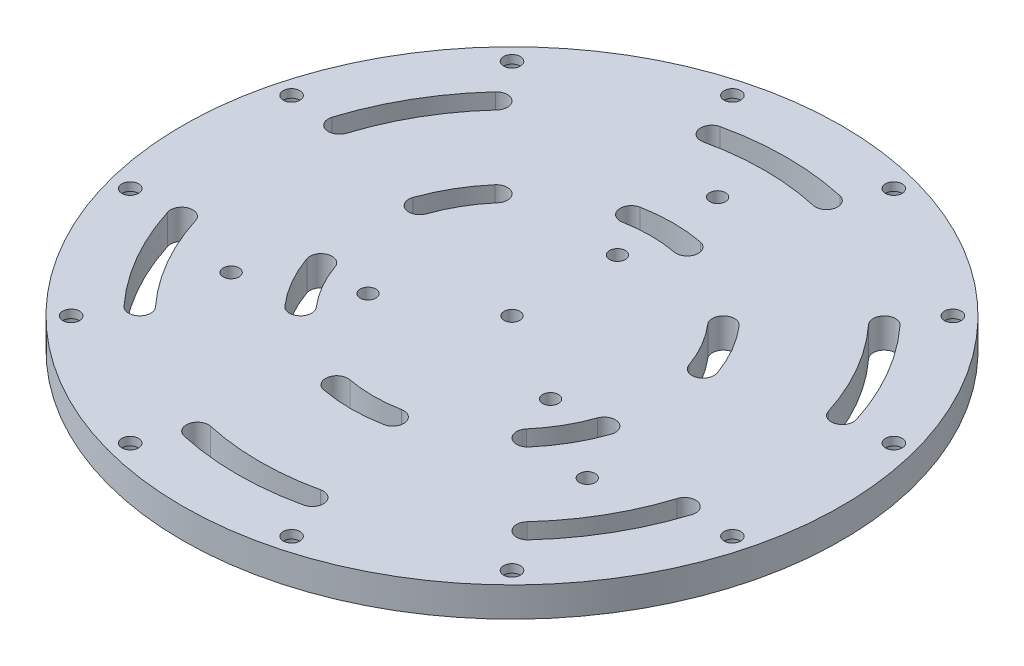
ISO-10303-21;
HEADER;
FILE_DESCRIPTION(('STEP AP214'),'2;1');
FILE_NAME('part.step','',(''),(''),'','','');
FILE_SCHEMA(('AUTOMOTIVE_DESIGN { 1 0 10303 214 1 1 1 1 }'));
ENDSEC;
DATA;
#1=APPLICATION_CONTEXT('core data for automotive mechanical design processes');
#2=APPLICATION_PROTOCOL_DEFINITION('international standard','automotive_design',2000,#1);
#3=PRODUCT_CONTEXT('',#1,'mechanical');
#4=PRODUCT('Part','Part','',(#3));
#5=PRODUCT_RELATED_PRODUCT_CATEGORY('part','',(#4));
#6=PRODUCT_DEFINITION_FORMATION('','',#4);
#7=PRODUCT_DEFINITION_CONTEXT('part definition',#1,'design');
#8=PRODUCT_DEFINITION('design','',#6,#7);
#9=PRODUCT_DEFINITION_SHAPE('','',#8);
#10=(LENGTH_UNIT() NAMED_UNIT(*) SI_UNIT(.MILLI.,.METRE.));
#11=(NAMED_UNIT(*) PLANE_ANGLE_UNIT() SI_UNIT($,.RADIAN.));
#12=(NAMED_UNIT(*) SI_UNIT($,.STERADIAN.) SOLID_ANGLE_UNIT());
#13=UNCERTAINTY_MEASURE_WITH_UNIT(LENGTH_MEASURE(1.E-05),#10,'distance_accuracy_value','');
#14=(GEOMETRIC_REPRESENTATION_CONTEXT(3) GLOBAL_UNCERTAINTY_ASSIGNED_CONTEXT((#13)) GLOBAL_UNIT_ASSIGNED_CONTEXT((#10,
#11,#12)) REPRESENTATION_CONTEXT('',''));
#15=CARTESIAN_POINT('',(0.,0.,0.));
#16=DIRECTION('',(0.,0.,1.));
#17=DIRECTION('',(1.,0.,0.));
#18=AXIS2_PLACEMENT_3D('',#15,#16,#17);
#19=CARTESIAN_POINT('',(0.,0.,0.));
#20=DIRECTION('',(0.,1.,0.));
#21=DIRECTION('',(0.,0.,1.));
#22=AXIS2_PLACEMENT_3D('',#19,#20,#21);
#23=PLANE('',#22);
#24=CARTESIAN_POINT('',(0.,0.,0.));
#25=DIRECTION('',(0.,-1.,0.));
#26=DIRECTION('',(0.,0.,1.));
#27=AXIS2_PLACEMENT_3D('',#24,#25,#26);
#28=CIRCLE('',#27,68.8975);
#29=CARTESIAN_POINT('',(12.8409305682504,0.,67.6902947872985));
#30=VERTEX_POINT('',#29);
#31=CARTESIAN_POINT('',(-12.8409305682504,0.,67.6902947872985));
#32=VERTEX_POINT('',#31);
#33=EDGE_CURVE('E463',#30,#32,#28,.T.);
#34=ORIENTED_EDGE('',*,*,#33,.F.);
#35=CARTESIAN_POINT('',(11.9533086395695,0.,63.0112421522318));
#36=DIRECTION('',(0.,-1.,0.));
#37=DIRECTION('',(0.,0.,1.));
#38=AXIS2_PLACEMENT_3D('',#35,#36,#37);
#39=CIRCLE('',#38,4.76250000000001);
#40=CARTESIAN_POINT('',(11.0656867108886,0.,58.3321895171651));
#41=VERTEX_POINT('',#40);
#42=EDGE_CURVE('E51',#41,#30,#39,.T.);
#43=ORIENTED_EDGE('',*,*,#42,.F.);
#44=CARTESIAN_POINT('',(0.,0.,0.));
#45=DIRECTION('',(0.,1.,0.));
#46=DIRECTION('',(0.,0.,1.));
#47=AXIS2_PLACEMENT_3D('',#44,#45,#46);
#48=CIRCLE('',#47,59.3725);
#49=CARTESIAN_POINT('',(-11.0656867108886,0.,58.3321895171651));
#50=VERTEX_POINT('',#49);
#51=EDGE_CURVE('E452',#50,#41,#48,.T.);
#52=ORIENTED_EDGE('',*,*,#51,.F.);
#53=CARTESIAN_POINT('',(-11.9533086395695,0.,63.0112421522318));
#54=DIRECTION('',(0.,-1.,0.));
#55=DIRECTION('',(0.,0.,1.));
#56=AXIS2_PLACEMENT_3D('',#53,#54,#55);
#57=CIRCLE('',#56,4.76250000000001);
#58=EDGE_CURVE('E467',#32,#50,#57,.T.);
#59=ORIENTED_EDGE('',*,*,#58,.F.);
#60=EDGE_LOOP('',(#34,#43,#52,#59));
#61=FACE_BOUND('',#60,.T.);
#62=CARTESIAN_POINT('',(0.,0.,0.));
#63=DIRECTION('',(0.,-1.,0.));
#64=DIRECTION('',(0.866025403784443,0.,0.499999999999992));
#65=AXIS2_PLACEMENT_3D('',#62,#63,#64);
#66=CIRCLE('',#65,117.475);
#67=CARTESIAN_POINT('',(112.086088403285,0.,35.1722107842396));
#68=VERTEX_POINT('',#67);
#69=CARTESIAN_POINT('',(86.5030722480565,0.,79.4832945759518));
#70=VERTEX_POINT('',#69);
#71=EDGE_CURVE('E495',#68,#70,#66,.T.);
#72=ORIENTED_EDGE('',*,*,#71,.F.);
#73=CARTESIAN_POINT('',(107.542057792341,0.,33.7463103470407));
#74=DIRECTION('',(0.,-1.,0.));
#75=DIRECTION('',(0.866025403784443,0.,0.499999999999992));
#76=AXIS2_PLACEMENT_3D('',#73,#74,#75);
#77=CIRCLE('',#76,4.7625);
#78=CARTESIAN_POINT('',(102.998027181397,0.,32.3204099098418));
#79=VERTEX_POINT('',#78);
#80=EDGE_CURVE('E59',#79,#68,#77,.T.);
#81=ORIENTED_EDGE('',*,*,#80,.F.);
#82=CARTESIAN_POINT('',(0.,0.,0.));
#83=DIRECTION('',(0.,1.,0.));
#84=DIRECTION('',(0.866025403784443,0.,0.499999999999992));
#85=AXIS2_PLACEMENT_3D('',#82,#83,#84);
#86=CIRCLE('',#85,107.95);
#87=CARTESIAN_POINT('',(79.4893096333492,0.,73.0387031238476));
#88=VERTEX_POINT('',#87);
#89=EDGE_CURVE('E484',#88,#79,#86,.T.);
#90=ORIENTED_EDGE('',*,*,#89,.F.);
#91=CARTESIAN_POINT('',(82.9961909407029,0.,76.2609988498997));
#92=DIRECTION('',(0.,-1.,0.));
#93=DIRECTION('',(0.866025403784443,0.,0.499999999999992));
#94=AXIS2_PLACEMENT_3D('',#91,#92,#93);
#95=CIRCLE('',#94,4.7625);
#96=EDGE_CURVE('E498',#70,#88,#95,.T.);
#97=ORIENTED_EDGE('',*,*,#96,.F.);
#98=EDGE_LOOP('',(#72,#81,#90,#97));
#99=FACE_BOUND('',#98,.T.);
#100=CARTESIAN_POINT('',(0.,0.,0.));
#101=DIRECTION('',(0.,-1.,0.));
#102=DIRECTION('',(0.866025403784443,0.,0.499999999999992));
#103=AXIS2_PLACEMENT_3D('',#100,#101,#102);
#104=CIRCLE('',#103,68.8975);
#105=CARTESIAN_POINT('',(65.0419801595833,0.,22.7245753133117));
#106=VERTEX_POINT('',#105);
#107=CARTESIAN_POINT('',(52.2010495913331,0.,44.9657194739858));
#108=VERTEX_POINT('',#107);
#109=EDGE_CURVE('E401',#106,#108,#104,.T.);
#110=ORIENTED_EDGE('',*,*,#109,.F.);
#111=CARTESIAN_POINT('',(60.5459907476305,0.,21.1537521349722));
#112=DIRECTION('',(0.,-1.,0.));
#113=DIRECTION('',(0.866025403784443,0.,0.499999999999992));
#114=AXIS2_PLACEMENT_3D('',#111,#112,#113);
#115=CIRCLE('',#114,4.76250000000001);
#116=CARTESIAN_POINT('',(56.0500013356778,0.,19.5829289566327));
#117=VERTEX_POINT('',#116);
#118=EDGE_CURVE('E399',#117,#106,#115,.T.);
#119=ORIENTED_EDGE('',*,*,#118,.F.);
#120=CARTESIAN_POINT('',(0.,0.,0.));
#121=DIRECTION('',(0.,1.,0.));
#122=DIRECTION('',(0.866025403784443,0.,0.499999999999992));
#123=AXIS2_PLACEMENT_3D('',#120,#121,#122);
#124=CIRCLE('',#123,59.3725);
#125=CARTESIAN_POINT('',(44.9843146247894,0.,38.7492605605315));
#126=VERTEX_POINT('',#125);
#127=EDGE_CURVE('E389',#126,#117,#124,.T.);
#128=ORIENTED_EDGE('',*,*,#127,.F.);
#129=CARTESIAN_POINT('',(48.5926821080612,0.,41.8574900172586));
#130=DIRECTION('',(0.,-1.,0.));
#131=DIRECTION('',(0.866025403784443,0.,0.499999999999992));
#132=AXIS2_PLACEMENT_3D('',#129,#130,#131);
#133=CIRCLE('',#132,4.76250000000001);
#134=EDGE_CURVE('E405',#108,#126,#133,.T.);
#135=ORIENTED_EDGE('',*,*,#134,.F.);
#136=EDGE_LOOP('',(#110,#119,#128,#135));
#137=FACE_BOUND('',#136,.T.);
#138=CARTESIAN_POINT('',(0.,0.,0.));
#139=DIRECTION('',(0.,-1.,0.));
#140=DIRECTION('',(0.866025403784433,0.,-0.50000000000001));
#141=AXIS2_PLACEMENT_3D('',#138,#139,#140);
#142=CIRCLE('',#141,117.475);
#143=CARTESIAN_POINT('',(86.5030722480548,0.,-79.4832945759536));
#144=VERTEX_POINT('',#143);
#145=CARTESIAN_POINT('',(112.086088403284,0.,-35.172210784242));
#146=VERTEX_POINT('',#145);
#147=EDGE_CURVE('E433',#144,#146,#142,.T.);
#148=ORIENTED_EDGE('',*,*,#147,.F.);
#149=CARTESIAN_POINT('',(82.9961909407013,0.,-76.2609988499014));
#150=DIRECTION('',(0.,-1.,0.));
#151=DIRECTION('',(0.866025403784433,0.,-0.50000000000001));
#152=AXIS2_PLACEMENT_3D('',#149,#150,#151);
#153=CIRCLE('',#152,4.7625);
#154=CARTESIAN_POINT('',(79.4893096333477,0.,-73.0387031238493));
#155=VERTEX_POINT('',#154);
#156=EDGE_CURVE('E381',#155,#144,#153,.T.);
#157=ORIENTED_EDGE('',*,*,#156,.F.);
#158=CARTESIAN_POINT('',(0.,0.,0.));
#159=DIRECTION('',(0.,1.,0.));
#160=DIRECTION('',(0.866025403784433,0.,-0.50000000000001));
#161=AXIS2_PLACEMENT_3D('',#158,#159,#160);
#162=CIRCLE('',#161,107.95);
#163=CARTESIAN_POINT('',(102.998027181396,0.,-32.320409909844));
#164=VERTEX_POINT('',#163);
#165=EDGE_CURVE('E422',#164,#155,#162,.T.);
#166=ORIENTED_EDGE('',*,*,#165,.F.);
#167=CARTESIAN_POINT('',(107.54205779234,0.,-33.746310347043));
#168=DIRECTION('',(0.,-1.,0.));
#169=DIRECTION('',(0.866025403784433,0.,-0.50000000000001));
#170=AXIS2_PLACEMENT_3D('',#167,#168,#169);
#171=CIRCLE('',#170,4.7625);
#172=EDGE_CURVE('E436',#146,#164,#171,.T.);
#173=ORIENTED_EDGE('',*,*,#172,.F.);
#174=EDGE_LOOP('',(#148,#157,#166,#173));
#175=FACE_BOUND('',#174,.T.);
#176=CARTESIAN_POINT('',(0.,0.,0.));
#177=DIRECTION('',(0.,-1.,0.));
#178=DIRECTION('',(-0.86602540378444,0.,-0.499999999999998));
#179=AXIS2_PLACEMENT_3D('',#176,#177,#178);
#180=CIRCLE('',#179,68.8975);
#181=CARTESIAN_POINT('',(-65.0419801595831,0.,-22.7245753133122));
#182=VERTEX_POINT('',#181);
#183=CARTESIAN_POINT('',(-52.2010495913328,0.,-44.9657194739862));
#184=VERTEX_POINT('',#183);
#185=EDGE_CURVE('E589',#182,#184,#180,.T.);
#186=ORIENTED_EDGE('',*,*,#185,.F.);
#187=CARTESIAN_POINT('',(-60.5459907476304,0.,-21.1537521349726));
#188=DIRECTION('',(0.,-1.,0.));
#189=DIRECTION('',(-0.86602540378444,0.,-0.499999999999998));
#190=AXIS2_PLACEMENT_3D('',#187,#188,#189);
#191=CIRCLE('',#190,4.76250000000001);
#192=CARTESIAN_POINT('',(-56.0500013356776,0.,-19.5829289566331));
#193=VERTEX_POINT('',#192);
#194=EDGE_CURVE('E587',#193,#182,#191,.T.);
#195=ORIENTED_EDGE('',*,*,#194,.F.);
#196=CARTESIAN_POINT('',(0.,0.,0.));
#197=DIRECTION('',(0.,1.,0.));
#198=DIRECTION('',(-0.86602540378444,0.,-0.499999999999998));
#199=AXIS2_PLACEMENT_3D('',#196,#197,#198);
#200=CIRCLE('',#199,59.3725);
#201=CARTESIAN_POINT('',(-44.9843146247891,0.,-38.7492605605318));
#202=VERTEX_POINT('',#201);
#203=EDGE_CURVE('E577',#202,#193,#200,.T.);
#204=ORIENTED_EDGE('',*,*,#203,.F.);
#205=CARTESIAN_POINT('',(-48.5926821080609,0.,-41.857490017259));
#206=DIRECTION('',(0.,-1.,0.));
#207=DIRECTION('',(-0.86602540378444,0.,-0.499999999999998));
#208=AXIS2_PLACEMENT_3D('',#205,#206,#207);
#209=CIRCLE('',#208,4.76250000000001);
#210=EDGE_CURVE('E593',#184,#202,#209,.T.);
#211=ORIENTED_EDGE('',*,*,#210,.F.);
#212=EDGE_LOOP('',(#186,#195,#204,#211));
#213=FACE_BOUND('',#212,.T.);
#214=CARTESIAN_POINT('',(0.,0.,0.));
#215=DIRECTION('',(0.,-1.,0.));
#216=DIRECTION('',(-0.866025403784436,0.,0.500000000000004));
#217=AXIS2_PLACEMENT_3D('',#214,#215,#216);
#218=CIRCLE('',#217,117.475);
#219=CARTESIAN_POINT('',(-86.5030722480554,0.,79.483294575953));
#220=VERTEX_POINT('',#219);
#221=CARTESIAN_POINT('',(-112.086088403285,0.,35.1722107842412));
#222=VERTEX_POINT('',#221);
#223=EDGE_CURVE('E622',#220,#222,#218,.T.);
#224=ORIENTED_EDGE('',*,*,#223,.F.);
#225=CARTESIAN_POINT('',(-82.9961909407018,0.,76.2609988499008));
#226=DIRECTION('',(0.,-1.,0.));
#227=DIRECTION('',(-0.866025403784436,0.,0.500000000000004));
#228=AXIS2_PLACEMENT_3D('',#225,#226,#227);
#229=CIRCLE('',#228,4.7625);
#230=CARTESIAN_POINT('',(-79.4893096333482,0.,73.0387031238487));
#231=VERTEX_POINT('',#230);
#232=EDGE_CURVE('E536',#231,#220,#229,.T.);
#233=ORIENTED_EDGE('',*,*,#232,.F.);
#234=CARTESIAN_POINT('',(0.,0.,0.));
#235=DIRECTION('',(0.,1.,0.));
#236=DIRECTION('',(-0.866025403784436,0.,0.500000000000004));
#237=AXIS2_PLACEMENT_3D('',#234,#235,#236);
#238=CIRCLE('',#237,107.95);
#239=CARTESIAN_POINT('',(-102.998027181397,0.,32.3204099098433));
#240=VERTEX_POINT('',#239);
#241=EDGE_CURVE('E611',#240,#231,#238,.T.);
#242=ORIENTED_EDGE('',*,*,#241,.F.);
#243=CARTESIAN_POINT('',(-107.542057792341,0.,33.7463103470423));
#244=DIRECTION('',(0.,-1.,0.));
#245=DIRECTION('',(-0.866025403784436,0.,0.500000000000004));
#246=AXIS2_PLACEMENT_3D('',#243,#244,#245);
#247=CIRCLE('',#246,4.7625);
#248=EDGE_CURVE('E625',#222,#240,#247,.T.);
#249=ORIENTED_EDGE('',*,*,#248,.F.);
#250=EDGE_LOOP('',(#224,#233,#242,#249));
#251=FACE_BOUND('',#250,.T.);
#252=CARTESIAN_POINT('',(0.,0.,0.));
#253=DIRECTION('',(0.,-1.,0.));
#254=DIRECTION('',(-0.866025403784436,0.,0.500000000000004));
#255=AXIS2_PLACEMENT_3D('',#252,#253,#254);
#256=CIRCLE('',#255,68.8975);
#257=CARTESIAN_POINT('',(-52.2010495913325,0.,44.9657194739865));
#258=VERTEX_POINT('',#257);
#259=CARTESIAN_POINT('',(-65.041980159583,0.,22.7245753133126));
#260=VERTEX_POINT('',#259);
#261=EDGE_CURVE('E525',#258,#260,#256,.T.);
#262=ORIENTED_EDGE('',*,*,#261,.F.);
#263=CARTESIAN_POINT('',(-48.5926821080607,0.,41.8574900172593));
#264=DIRECTION('',(0.,-1.,0.));
#265=DIRECTION('',(-0.866025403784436,0.,0.500000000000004));
#266=AXIS2_PLACEMENT_3D('',#263,#264,#265);
#267=CIRCLE('',#266,4.76250000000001);
#268=CARTESIAN_POINT('',(-44.9843146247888,0.,38.7492605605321));
#269=VERTEX_POINT('',#268);
#270=EDGE_CURVE('E523',#269,#258,#267,.T.);
#271=ORIENTED_EDGE('',*,*,#270,.F.);
#272=CARTESIAN_POINT('',(0.,0.,0.));
#273=DIRECTION('',(0.,1.,0.));
#274=DIRECTION('',(-0.866025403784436,0.,0.500000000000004));
#275=AXIS2_PLACEMENT_3D('',#272,#273,#274);
#276=CIRCLE('',#275,59.3725);
#277=CARTESIAN_POINT('',(-56.0500013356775,0.,19.5829289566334));
#278=VERTEX_POINT('',#277);
#279=EDGE_CURVE('E513',#278,#269,#276,.T.);
#280=ORIENTED_EDGE('',*,*,#279,.F.);
#281=CARTESIAN_POINT('',(-60.5459907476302,0.,21.153752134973));
#282=DIRECTION('',(0.,-1.,0.));
#283=DIRECTION('',(-0.866025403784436,0.,0.500000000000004));
#284=AXIS2_PLACEMENT_3D('',#281,#282,#283);
#285=CIRCLE('',#284,4.76250000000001);
#286=EDGE_CURVE('E529',#260,#278,#285,.T.);
#287=ORIENTED_EDGE('',*,*,#286,.F.);
#288=EDGE_LOOP('',(#262,#271,#280,#287));
#289=FACE_BOUND('',#288,.T.);
#290=CARTESIAN_POINT('',(0.,0.,0.));
#291=DIRECTION('',(0.,-1.,0.));
#292=DIRECTION('',(0.,0.,1.));
#293=AXIS2_PLACEMENT_3D('',#290,#291,#292);
#294=CIRCLE('',#293,117.475);
#295=CARTESIAN_POINT('',(25.583016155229,0.,114.655505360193));
#296=VERTEX_POINT('',#295);
#297=CARTESIAN_POINT('',(-25.5830161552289,0.,114.655505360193));
#298=VERTEX_POINT('',#297);
#299=EDGE_CURVE('E558',#296,#298,#294,.T.);
#300=ORIENTED_EDGE('',*,*,#299,.F.);
#301=CARTESIAN_POINT('',(24.5458668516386,0.,110.007309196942));
#302=DIRECTION('',(0.,-1.,0.));
#303=DIRECTION('',(0.,0.,1.));
#304=AXIS2_PLACEMENT_3D('',#301,#302,#303);
#305=CIRCLE('',#304,4.7625);
#306=CARTESIAN_POINT('',(23.5087175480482,0.,105.359113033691));
#307=VERTEX_POINT('',#306);
#308=EDGE_CURVE('E474',#307,#296,#305,.T.);
#309=ORIENTED_EDGE('',*,*,#308,.F.);
#310=CARTESIAN_POINT('',(0.,0.,0.));
#311=DIRECTION('',(0.,1.,0.));
#312=DIRECTION('',(0.,0.,1.));
#313=AXIS2_PLACEMENT_3D('',#310,#311,#312);
#314=CIRCLE('',#313,107.95);
#315=CARTESIAN_POINT('',(-23.5087175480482,0.,105.359113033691));
#316=VERTEX_POINT('',#315);
#317=EDGE_CURVE('E547',#316,#307,#314,.T.);
#318=ORIENTED_EDGE('',*,*,#317,.F.);
#319=CARTESIAN_POINT('',(-24.5458668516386,0.,110.007309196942));
#320=DIRECTION('',(0.,-1.,0.));
#321=DIRECTION('',(0.,0.,1.));
#322=AXIS2_PLACEMENT_3D('',#319,#320,#321);
#323=CIRCLE('',#322,4.7625);
#324=EDGE_CURVE('E561',#298,#316,#323,.T.);
#325=ORIENTED_EDGE('',*,*,#324,.F.);
#326=EDGE_LOOP('',(#300,#309,#318,#325));
#327=FACE_BOUND('',#326,.T.);
#328=CARTESIAN_POINT('',(0.,0.,0.));
#329=DIRECTION('',(0.,-1.,0.));
#330=DIRECTION('',(0.866025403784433,0.,-0.50000000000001));
#331=AXIS2_PLACEMENT_3D('',#328,#329,#330);
#332=CIRCLE('',#331,68.8975);
#333=CARTESIAN_POINT('',(52.2010495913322,0.,-44.9657194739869));
#334=VERTEX_POINT('',#333);
#335=CARTESIAN_POINT('',(65.0419801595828,0.,-22.724575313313));
#336=VERTEX_POINT('',#335);
#337=EDGE_CURVE('E375',#334,#336,#332,.T.);
#338=ORIENTED_EDGE('',*,*,#337,.F.);
#339=CARTESIAN_POINT('',(48.5926821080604,0.,-41.8574900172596));
#340=DIRECTION('',(0.,-1.,0.));
#341=DIRECTION('',(0.866025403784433,0.,-0.50000000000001));
#342=AXIS2_PLACEMENT_3D('',#339,#340,#341);
#343=CIRCLE('',#342,4.76250000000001);
#344=CARTESIAN_POINT('',(44.9843146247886,0.,-38.7492605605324));
#345=VERTEX_POINT('',#344);
#346=EDGE_CURVE('E348',#345,#334,#343,.T.);
#347=ORIENTED_EDGE('',*,*,#346,.F.);
#348=CARTESIAN_POINT('',(0.,0.,0.));
#349=DIRECTION('',(0.,1.,0.));
#350=DIRECTION('',(0.866025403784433,0.,-0.50000000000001));
#351=AXIS2_PLACEMENT_3D('',#348,#349,#350);
#352=CIRCLE('',#351,59.3725);
#353=CARTESIAN_POINT('',(56.0500013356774,0.,-19.5829289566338));
#354=VERTEX_POINT('',#353);
#355=EDGE_CURVE('E366',#354,#345,#352,.T.);
#356=ORIENTED_EDGE('',*,*,#355,.F.);
#357=CARTESIAN_POINT('',(60.5459907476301,0.,-21.1537521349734));
#358=DIRECTION('',(0.,-1.,0.));
#359=DIRECTION('',(0.866025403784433,0.,-0.50000000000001));
#360=AXIS2_PLACEMENT_3D('',#357,#358,#359);
#361=CIRCLE('',#360,4.76250000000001);
#362=EDGE_CURVE('E369',#336,#354,#361,.T.);
#363=ORIENTED_EDGE('',*,*,#362,.F.);
#364=EDGE_LOOP('',(#338,#347,#356,#363));
#365=FACE_BOUND('',#364,.T.);
#366=CARTESIAN_POINT('',(0.,0.,0.));
#367=DIRECTION('',(0.,-1.,0.));
#368=DIRECTION('',(-0.86602540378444,0.,-0.499999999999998));
#369=AXIS2_PLACEMENT_3D('',#366,#367,#368);
#370=CIRCLE('',#369,117.475);
#371=CARTESIAN_POINT('',(-112.086088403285,0.,-35.1722107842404));
#372=VERTEX_POINT('',#371);
#373=CARTESIAN_POINT('',(-86.503072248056,0.,-79.4832945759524));
#374=VERTEX_POINT('',#373);
#375=EDGE_CURVE('E652',#372,#374,#370,.T.);
#376=ORIENTED_EDGE('',*,*,#375,.F.);
#377=CARTESIAN_POINT('',(-107.542057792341,0.,-33.7463103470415));
#378=DIRECTION('',(0.,-1.,0.));
#379=DIRECTION('',(-0.86602540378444,0.,-0.499999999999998));
#380=AXIS2_PLACEMENT_3D('',#377,#378,#379);
#381=CIRCLE('',#380,4.7625);
#382=CARTESIAN_POINT('',(-102.998027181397,0.,-32.3204099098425));
#383=VERTEX_POINT('',#382);
#384=EDGE_CURVE('E600',#383,#372,#381,.T.);
#385=ORIENTED_EDGE('',*,*,#384,.F.);
#386=CARTESIAN_POINT('',(0.,0.,0.));
#387=DIRECTION('',(0.,1.,0.));
#388=DIRECTION('',(-0.86602540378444,0.,-0.499999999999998));
#389=AXIS2_PLACEMENT_3D('',#386,#387,#388);
#390=CIRCLE('',#389,107.95);
#391=CARTESIAN_POINT('',(-79.4893096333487,0.,-73.0387031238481));
#392=VERTEX_POINT('',#391);
#393=EDGE_CURVE('E641',#392,#383,#390,.T.);
#394=ORIENTED_EDGE('',*,*,#393,.F.);
#395=CARTESIAN_POINT('',(-82.9961909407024,0.,-76.2609988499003));
#396=DIRECTION('',(0.,-1.,0.));
#397=DIRECTION('',(-0.86602540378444,0.,-0.499999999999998));
#398=AXIS2_PLACEMENT_3D('',#395,#396,#397);
#399=CIRCLE('',#398,4.7625);
#400=EDGE_CURVE('E655',#374,#392,#399,.T.);
#401=ORIENTED_EDGE('',*,*,#400,.F.);
#402=EDGE_LOOP('',(#376,#385,#394,#401));
#403=FACE_BOUND('',#402,.T.);
#404=CARTESIAN_POINT('',(0.,0.,0.));
#405=DIRECTION('',(0.,-1.,0.));
#406=DIRECTION('',(0.,0.,-1.));
#407=AXIS2_PLACEMENT_3D('',#404,#405,#406);
#408=CIRCLE('',#407,117.475);
#409=CARTESIAN_POINT('',(-25.583016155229,0.,-114.655505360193));
#410=VERTEX_POINT('',#409);
#411=CARTESIAN_POINT('',(25.5830161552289,0.,-114.655505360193));
#412=VERTEX_POINT('',#411);
#413=EDGE_CURVE('E685',#410,#412,#408,.T.);
#414=ORIENTED_EDGE('',*,*,#413,.F.);
#415=CARTESIAN_POINT('',(-24.5458668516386,0.,-110.007309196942));
#416=DIRECTION('',(0.,-1.,0.));
#417=DIRECTION('',(0.,0.,-1.));
#418=AXIS2_PLACEMENT_3D('',#415,#416,#417);
#419=CIRCLE('',#418,4.7625);
#420=CARTESIAN_POINT('',(-23.5087175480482,0.,-105.359113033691));
#421=VERTEX_POINT('',#420);
#422=EDGE_CURVE('E683',#421,#410,#419,.T.);
#423=ORIENTED_EDGE('',*,*,#422,.F.);
#424=CARTESIAN_POINT('',(0.,0.,0.));
#425=DIRECTION('',(0.,1.,0.));
#426=DIRECTION('',(0.,0.,-1.));
#427=AXIS2_PLACEMENT_3D('',#424,#425,#426);
#428=CIRCLE('',#427,107.95);
#429=CARTESIAN_POINT('',(23.5087175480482,0.,-105.359113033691));
#430=VERTEX_POINT('',#429);
#431=EDGE_CURVE('E673',#430,#421,#428,.T.);
#432=ORIENTED_EDGE('',*,*,#431,.F.);
#433=CARTESIAN_POINT('',(24.5458668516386,0.,-110.007309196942));
#434=DIRECTION('',(0.,-1.,0.));
#435=DIRECTION('',(0.,0.,-1.));
#436=AXIS2_PLACEMENT_3D('',#433,#434,#435);
#437=CIRCLE('',#436,4.7625);
#438=EDGE_CURVE('E689',#412,#430,#437,.T.);
#439=ORIENTED_EDGE('',*,*,#438,.F.);
#440=EDGE_LOOP('',(#414,#423,#432,#439));
#441=FACE_BOUND('',#440,.T.);
#442=CARTESIAN_POINT('',(0.,0.,0.));
#443=DIRECTION('',(0.,-1.,0.));
#444=DIRECTION('',(0.,0.,-1.));
#445=AXIS2_PLACEMENT_3D('',#442,#443,#444);
#446=CIRCLE('',#445,68.8975);
#447=CARTESIAN_POINT('',(-12.8409305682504,0.,-67.6902947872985));
#448=VERTEX_POINT('',#447);
#449=CARTESIAN_POINT('',(12.8409305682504,0.,-67.6902947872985));
#450=VERTEX_POINT('',#449);
#451=EDGE_CURVE('E718',#448,#450,#446,.T.);
#452=ORIENTED_EDGE('',*,*,#451,.F.);
#453=CARTESIAN_POINT('',(-11.9533086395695,0.,-63.0112421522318));
#454=DIRECTION('',(0.,-1.,0.));
#455=DIRECTION('',(0.,0.,-1.));
#456=AXIS2_PLACEMENT_3D('',#453,#454,#455);
#457=CIRCLE('',#456,4.76250000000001);
#458=CARTESIAN_POINT('',(-11.0656867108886,0.,-58.3321895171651));
#459=VERTEX_POINT('',#458);
#460=EDGE_CURVE('E662',#459,#448,#457,.T.);
#461=ORIENTED_EDGE('',*,*,#460,.F.);
#462=CARTESIAN_POINT('',(0.,0.,0.));
#463=DIRECTION('',(0.,1.,0.));
#464=DIRECTION('',(0.,0.,-1.));
#465=AXIS2_PLACEMENT_3D('',#462,#463,#464);
#466=CIRCLE('',#465,59.3725);
#467=CARTESIAN_POINT('',(11.0656867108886,0.,-58.3321895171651));
#468=VERTEX_POINT('',#467);
#469=EDGE_CURVE('E707',#468,#459,#466,.T.);
#470=ORIENTED_EDGE('',*,*,#469,.F.);
#471=CARTESIAN_POINT('',(11.9533086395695,0.,-63.0112421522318));
#472=DIRECTION('',(0.,-1.,0.));
#473=DIRECTION('',(0.,0.,-1.));
#474=AXIS2_PLACEMENT_3D('',#471,#472,#473);
#475=CIRCLE('',#474,4.76250000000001);
#476=EDGE_CURVE('E721',#450,#468,#475,.T.);
#477=ORIENTED_EDGE('',*,*,#476,.F.);
#478=EDGE_LOOP('',(#452,#461,#470,#477));
#479=FACE_BOUND('',#478,.T.);
#480=CARTESIAN_POINT('',(-39.0447553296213,0.,22.5425000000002));
#481=DIRECTION('',(0.,-1.,0.));
#482=DIRECTION('',(-0.866025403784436,0.,0.500000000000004));
#483=AXIS2_PLACEMENT_3D('',#480,#481,#482);
#484=CIRCLE('',#483,3.3782);
#485=CARTESIAN_POINT('',(-41.9703623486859,0.,24.2316000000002));
#486=VERTEX_POINT('',#485);
#487=EDGE_CURVE('E736',#486,#486,#484,.T.);
#488=ORIENTED_EDGE('',*,*,#487,.F.);
#489=EDGE_LOOP('',(#488));
#490=FACE_BOUND('',#489,.T.);
#491=CARTESIAN_POINT('',(39.0447553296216,0.,22.5424999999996));
#492=DIRECTION('',(0.,-1.,0.));
#493=DIRECTION('',(0.866025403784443,0.,0.499999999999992));
#494=AXIS2_PLACEMENT_3D('',#491,#492,#493);
#495=CIRCLE('',#494,3.3782);
#496=CARTESIAN_POINT('',(41.9703623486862,0.,24.2315999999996));
#497=VERTEX_POINT('',#496);
#498=EDGE_CURVE('E737',#497,#497,#495,.T.);
#499=ORIENTED_EDGE('',*,*,#498,.F.);
#500=EDGE_LOOP('',(#499));
#501=FACE_BOUND('',#500,.T.);
#502=CARTESIAN_POINT('',(-76.1647691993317,0.,43.9737500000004));
#503=DIRECTION('',(0.,-1.,0.));
#504=DIRECTION('',(-0.866025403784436,0.,0.500000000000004));
#505=AXIS2_PLACEMENT_3D('',#502,#503,#504);
#506=CIRCLE('',#505,3.3782);
#507=CARTESIAN_POINT('',(-79.0903762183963,0.,45.6628500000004));
#508=VERTEX_POINT('',#507);
#509=EDGE_CURVE('E748',#508,#508,#506,.T.);
#510=ORIENTED_EDGE('',*,*,#509,.F.);
#511=EDGE_LOOP('',(#510));
#512=FACE_BOUND('',#511,.T.);
#513=CARTESIAN_POINT('',(76.1647691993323,0.,43.9737499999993));
#514=DIRECTION('',(0.,-1.,0.));
#515=DIRECTION('',(0.866025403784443,0.,0.499999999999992));
#516=AXIS2_PLACEMENT_3D('',#513,#514,#515);
#517=CIRCLE('',#516,3.3782);
#518=CARTESIAN_POINT('',(79.0903762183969,0.,45.6628499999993));
#519=VERTEX_POINT('',#518);
#520=EDGE_CURVE('E749',#519,#519,#517,.T.);
#521=ORIENTED_EDGE('',*,*,#520,.F.);
#522=EDGE_LOOP('',(#521));
#523=FACE_BOUND('',#522,.T.);
#524=CARTESIAN_POINT('',(0.,0.,-87.9475));
#525=DIRECTION('',(0.,-1.,0.));
#526=DIRECTION('',(0.,0.,-1.));
#527=AXIS2_PLACEMENT_3D('',#524,#525,#526);
#528=CIRCLE('',#527,3.3782);
#529=CARTESIAN_POINT('',(0.,0.,-91.3257));
#530=VERTEX_POINT('',#529);
#531=EDGE_CURVE('E752',#530,#530,#528,.T.);
#532=ORIENTED_EDGE('',*,*,#531,.F.);
#533=EDGE_LOOP('',(#532));
#534=FACE_BOUND('',#533,.T.);
#535=CARTESIAN_POINT('',(0.,0.,-45.085));
#536=DIRECTION('',(0.,-1.,0.));
#537=DIRECTION('',(0.,0.,-1.));
#538=AXIS2_PLACEMENT_3D('',#535,#536,#537);
#539=CIRCLE('',#538,3.3782);
#540=CARTESIAN_POINT('',(0.,0.,-48.4632));
#541=VERTEX_POINT('',#540);
#542=EDGE_CURVE('E762',#541,#541,#539,.T.);
#543=ORIENTED_EDGE('',*,*,#542,.F.);
#544=EDGE_LOOP('',(#543));
#545=FACE_BOUND('',#544,.T.);
#546=CARTESIAN_POINT('',(0.,0.,0.));
#547=DIRECTION('',(0.,-1.,0.));
#548=DIRECTION('',(0.,0.,-1.));
#549=AXIS2_PLACEMENT_3D('',#546,#547,#548);
#550=CIRCLE('',#549,3.3782);
#551=CARTESIAN_POINT('',(0.,0.,-3.3782));
#552=VERTEX_POINT('',#551);
#553=EDGE_CURVE('E768',#552,#552,#550,.T.);
#554=ORIENTED_EDGE('',*,*,#553,.F.);
#555=EDGE_LOOP('',(#554));
#556=FACE_BOUND('',#555,.T.);
#557=CARTESIAN_POINT('',(128.806208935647,0.,34.5135196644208));
#558=DIRECTION('',(0.,-1.,0.));
#559=DIRECTION('',(0.,0.,-1.));
#560=AXIS2_PLACEMENT_3D('',#557,#558,#559);
#561=CIRCLE('',#560,6.34999999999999);
#562=CARTESIAN_POINT('',(128.806208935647,0.,28.1635196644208));
#563=VERTEX_POINT('',#562);
#564=EDGE_CURVE('E774',#563,#563,#561,.T.);
#565=ORIENTED_EDGE('',*,*,#564,.F.);
#566=EDGE_LOOP('',(#565));
#567=FACE_BOUND('',#566,.T.);
#568=CARTESIAN_POINT('',(94.2926892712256,0.,-94.2926892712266));
#569=DIRECTION('',(0.,-1.,0.));
#570=DIRECTION('',(0.,0.,-1.));
#571=AXIS2_PLACEMENT_3D('',#568,#569,#570);
#572=CIRCLE('',#571,6.34999999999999);
#573=CARTESIAN_POINT('',(94.2926892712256,0.,-100.642689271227));
#574=VERTEX_POINT('',#573);
#575=EDGE_CURVE('E786',#574,#574,#572,.T.);
#576=ORIENTED_EDGE('',*,*,#575,.F.);
#577=EDGE_LOOP('',(#576));
#578=FACE_BOUND('',#577,.T.);
#579=CARTESIAN_POINT('',(34.5135196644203,0.,-128.806208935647));
#580=DIRECTION('',(0.,-1.,0.));
#581=DIRECTION('',(0.,0.,-1.));
#582=AXIS2_PLACEMENT_3D('',#579,#580,#581);
#583=CIRCLE('',#582,6.35);
#584=CARTESIAN_POINT('',(34.5135196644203,0.,-135.156208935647));
#585=VERTEX_POINT('',#584);
#586=EDGE_CURVE('E798',#585,#585,#583,.T.);
#587=ORIENTED_EDGE('',*,*,#586,.F.);
#588=EDGE_LOOP('',(#587));
#589=FACE_BOUND('',#588,.T.);
#590=CARTESIAN_POINT('',(-34.5135196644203,0.,-128.806208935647));
#591=DIRECTION('',(0.,-1.,0.));
#592=DIRECTION('',(0.,0.,-1.));
#593=AXIS2_PLACEMENT_3D('',#590,#591,#592);
#594=CIRCLE('',#593,6.35);
#595=CARTESIAN_POINT('',(-34.5135196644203,0.,-135.156208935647));
#596=VERTEX_POINT('',#595);
#597=EDGE_CURVE('E810',#596,#596,#594,.T.);
#598=ORIENTED_EDGE('',*,*,#597,.F.);
#599=EDGE_LOOP('',(#598));
#600=FACE_BOUND('',#599,.T.);
#601=CARTESIAN_POINT('',(-128.806208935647,0.,34.5135196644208));
#602=DIRECTION('',(0.,-1.,0.));
#603=DIRECTION('',(0.,0.,-1.));
#604=AXIS2_PLACEMENT_3D('',#601,#602,#603);
#605=CIRCLE('',#604,6.34999999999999);
#606=CARTESIAN_POINT('',(-128.806208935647,0.,28.1635196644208));
#607=VERTEX_POINT('',#606);
#608=EDGE_CURVE('E834',#607,#607,#605,.T.);
#609=ORIENTED_EDGE('',*,*,#608,.F.);
#610=EDGE_LOOP('',(#609));
#611=FACE_BOUND('',#610,.T.);
#612=CARTESIAN_POINT('',(-94.2926892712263,0.,94.2926892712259));
#613=DIRECTION('',(0.,-1.,0.));
#614=DIRECTION('',(0.,0.,-1.));
#615=AXIS2_PLACEMENT_3D('',#612,#613,#614);
#616=CIRCLE('',#615,6.34999999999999);
#617=CARTESIAN_POINT('',(-94.2926892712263,0.,87.9426892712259));
#618=VERTEX_POINT('',#617);
#619=EDGE_CURVE('E846',#618,#618,#616,.T.);
#620=ORIENTED_EDGE('',*,*,#619,.F.);
#621=EDGE_LOOP('',(#620));
#622=FACE_BOUND('',#621,.T.);
#623=CARTESIAN_POINT('',(34.5135196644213,0.,128.806208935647));
#624=DIRECTION('',(0.,-1.,0.));
#625=DIRECTION('',(0.,0.,-1.));
#626=AXIS2_PLACEMENT_3D('',#623,#624,#625);
#627=CIRCLE('',#626,6.35);
#628=CARTESIAN_POINT('',(34.5135196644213,0.,122.456208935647));
#629=VERTEX_POINT('',#628);
#630=EDGE_CURVE('E858',#629,#629,#627,.T.);
#631=ORIENTED_EDGE('',*,*,#630,.F.);
#632=EDGE_LOOP('',(#631));
#633=FACE_BOUND('',#632,.T.);
#634=CARTESIAN_POINT('',(94.2926892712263,0.,94.2926892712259));
#635=DIRECTION('',(0.,-1.,0.));
#636=DIRECTION('',(0.,0.,-1.));
#637=AXIS2_PLACEMENT_3D('',#634,#635,#636);
#638=CIRCLE('',#637,6.34999999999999);
#639=CARTESIAN_POINT('',(94.2926892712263,0.,87.9426892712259));
#640=VERTEX_POINT('',#639);
#641=EDGE_CURVE('E870',#640,#640,#638,.T.);
#642=ORIENTED_EDGE('',*,*,#641,.F.);
#643=EDGE_LOOP('',(#642));
#644=FACE_BOUND('',#643,.T.);
#645=CARTESIAN_POINT('',(128.806208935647,0.,-34.5135196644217));
#646=DIRECTION('',(0.,-1.,0.));
#647=DIRECTION('',(0.,0.,-1.));
#648=AXIS2_PLACEMENT_3D('',#645,#646,#647);
#649=CIRCLE('',#648,6.34999999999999);
#650=CARTESIAN_POINT('',(128.806208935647,0.,-40.8635196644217));
#651=VERTEX_POINT('',#650);
#652=EDGE_CURVE('E882',#651,#651,#649,.T.);
#653=ORIENTED_EDGE('',*,*,#652,.F.);
#654=EDGE_LOOP('',(#653));
#655=FACE_BOUND('',#654,.T.);
#656=CARTESIAN_POINT('',(-34.5135196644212,0.,128.806208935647));
#657=DIRECTION('',(0.,-1.,0.));
#658=DIRECTION('',(0.,0.,-1.));
#659=AXIS2_PLACEMENT_3D('',#656,#657,#658);
#660=CIRCLE('',#659,6.35);
#661=CARTESIAN_POINT('',(-34.5135196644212,0.,122.456208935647));
#662=VERTEX_POINT('',#661);
#663=EDGE_CURVE('E894',#662,#662,#660,.T.);
#664=ORIENTED_EDGE('',*,*,#663,.F.);
#665=EDGE_LOOP('',(#664));
#666=FACE_BOUND('',#665,.T.);
#667=CARTESIAN_POINT('',(-94.2926892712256,0.,-94.2926892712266));
#668=DIRECTION('',(0.,-1.,0.));
#669=DIRECTION('',(0.,0.,-1.));
#670=AXIS2_PLACEMENT_3D('',#667,#668,#669);
#671=CIRCLE('',#670,6.34999999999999);
#672=CARTESIAN_POINT('',(-94.2926892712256,0.,-100.642689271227));
#673=VERTEX_POINT('',#672);
#674=EDGE_CURVE('E906',#673,#673,#671,.T.);
#675=ORIENTED_EDGE('',*,*,#674,.F.);
#676=EDGE_LOOP('',(#675));
#677=FACE_BOUND('',#676,.T.);
#678=CARTESIAN_POINT('',(0.,0.,0.));
#679=DIRECTION('',(0.,1.,0.));
#680=DIRECTION('',(0.,0.,1.));
#681=AXIS2_PLACEMENT_3D('',#678,#679,#680);
#682=CIRCLE('',#681,140.97);
#683=CARTESIAN_POINT('',(0.,0.,140.97));
#684=VERTEX_POINT('',#683);
#685=EDGE_CURVE('E40',#684,#684,#682,.T.);
#686=ORIENTED_EDGE('',*,*,#685,.F.);
#687=EDGE_LOOP('',(#686));
#688=FACE_BOUND('',#687,.T.);
#689=CARTESIAN_POINT('',(-128.806208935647,0.,-34.5135196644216));
#690=DIRECTION('',(0.,-1.,0.));
#691=DIRECTION('',(0.,0.,-1.));
#692=AXIS2_PLACEMENT_3D('',#689,#690,#691);
#693=CIRCLE('',#692,6.34999999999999);
#694=CARTESIAN_POINT('',(-128.806208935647,0.,-40.8635196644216));
#695=VERTEX_POINT('',#694);
#696=EDGE_CURVE('E822',#695,#695,#693,.T.);
#697=ORIENTED_EDGE('',*,*,#696,.F.);
#698=EDGE_LOOP('',(#697));
#699=FACE_BOUND('',#698,.T.);
#700=ADVANCED_FACE('F36',(#61,#99,#137,#175,#213,#251,#289,#327,#365,#403,#441,#479,#490,#501,
#512,#523,#534,#545,#556,#567,#578,#589,#600,#611,#622,#633,#644,#655,#666,#677,#688,#699),#23,.F.);
#701=CARTESIAN_POINT('',(0.,12.7,0.));
#702=DIRECTION('',(0.,-1.,0.));
#703=DIRECTION('',(0.,0.,-1.));
#704=AXIS2_PLACEMENT_3D('',#701,#702,#703);
#705=CYLINDRICAL_SURFACE('',#704,140.97);
#706=CARTESIAN_POINT('',(0.,12.7,0.));
#707=DIRECTION('',(0.,1.,0.));
#708=DIRECTION('',(0.,0.,1.));
#709=AXIS2_PLACEMENT_3D('',#706,#707,#708);
#710=CIRCLE('',#709,140.97);
#711=CARTESIAN_POINT('',(0.,12.7,140.97));
#712=VERTEX_POINT('',#711);
#713=EDGE_CURVE('E11',#712,#712,#710,.T.);
#714=ORIENTED_EDGE('',*,*,#713,.F.);
#715=EDGE_LOOP('',(#714));
#716=FACE_BOUND('',#715,.T.);
#717=ORIENTED_EDGE('',*,*,#685,.T.);
#718=EDGE_LOOP('',(#717));
#719=FACE_BOUND('',#718,.T.);
#720=ADVANCED_FACE('F38',(#716,#719),#705,.T.);
#721=CARTESIAN_POINT('',(0.,12.7,0.));
#722=DIRECTION('',(0.,1.,0.));
#723=DIRECTION('',(0.,0.,1.));
#724=AXIS2_PLACEMENT_3D('',#721,#722,#723);
#725=PLANE('',#724);
#726=CARTESIAN_POINT('',(11.9533086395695,12.7,63.0112421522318));
#727=DIRECTION('',(0.,-1.,0.));
#728=DIRECTION('',(0.,0.,1.));
#729=AXIS2_PLACEMENT_3D('',#726,#727,#728);
#730=CIRCLE('',#729,4.76250000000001);
#731=CARTESIAN_POINT('',(11.0656867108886,12.7,58.3321895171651));
#732=VERTEX_POINT('',#731);
#733=CARTESIAN_POINT('',(12.8409305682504,12.7,67.6902947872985));
#734=VERTEX_POINT('',#733);
#735=EDGE_CURVE('E448',#732,#734,#730,.T.);
#736=ORIENTED_EDGE('',*,*,#735,.T.);
#737=CARTESIAN_POINT('',(0.,12.7,0.));
#738=DIRECTION('',(0.,-1.,0.));
#739=DIRECTION('',(0.,0.,1.));
#740=AXIS2_PLACEMENT_3D('',#737,#738,#739);
#741=CIRCLE('',#740,68.8975);
#742=CARTESIAN_POINT('',(-12.8409305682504,12.7,67.6902947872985));
#743=VERTEX_POINT('',#742);
#744=EDGE_CURVE('E451',#734,#743,#741,.T.);
#745=ORIENTED_EDGE('',*,*,#744,.T.);
#746=CARTESIAN_POINT('',(-11.9533086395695,12.7,63.0112421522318));
#747=DIRECTION('',(0.,-1.,0.));
#748=DIRECTION('',(0.,0.,1.));
#749=AXIS2_PLACEMENT_3D('',#746,#747,#748);
#750=CIRCLE('',#749,4.76250000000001);
#751=CARTESIAN_POINT('',(-11.0656867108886,12.7,58.3321895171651));
#752=VERTEX_POINT('',#751);
#753=EDGE_CURVE('E455',#743,#752,#750,.T.);
#754=ORIENTED_EDGE('',*,*,#753,.T.);
#755=CARTESIAN_POINT('',(0.,12.7,0.));
#756=DIRECTION('',(0.,1.,0.));
#757=DIRECTION('',(0.,0.,1.));
#758=AXIS2_PLACEMENT_3D('',#755,#756,#757);
#759=CIRCLE('',#758,59.3725);
#760=EDGE_CURVE('E458',#752,#732,#759,.T.);
#761=ORIENTED_EDGE('',*,*,#760,.T.);
#762=EDGE_LOOP('',(#736,#745,#754,#761));
#763=FACE_BOUND('',#762,.T.);
#764=CARTESIAN_POINT('',(107.542057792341,12.7,33.7463103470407));
#765=DIRECTION('',(0.,-1.,0.));
#766=DIRECTION('',(0.866025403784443,0.,0.499999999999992));
#767=AXIS2_PLACEMENT_3D('',#764,#765,#766);
#768=CIRCLE('',#767,4.7625);
#769=CARTESIAN_POINT('',(102.998027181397,12.7,32.3204099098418));
#770=VERTEX_POINT('',#769);
#771=CARTESIAN_POINT('',(112.086088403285,12.7,35.1722107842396));
#772=VERTEX_POINT('',#771);
#773=EDGE_CURVE('E480',#770,#772,#768,.T.);
#774=ORIENTED_EDGE('',*,*,#773,.T.);
#775=CARTESIAN_POINT('',(0.,12.7,0.));
#776=DIRECTION('',(0.,-1.,0.));
#777=DIRECTION('',(0.866025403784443,0.,0.499999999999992));
#778=AXIS2_PLACEMENT_3D('',#775,#776,#777);
#779=CIRCLE('',#778,117.475);
#780=CARTESIAN_POINT('',(86.5030722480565,12.7,79.4832945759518));
#781=VERTEX_POINT('',#780);
#782=EDGE_CURVE('E483',#772,#781,#779,.T.);
#783=ORIENTED_EDGE('',*,*,#782,.T.);
#784=CARTESIAN_POINT('',(82.9961909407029,12.7,76.2609988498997));
#785=DIRECTION('',(0.,-1.,0.));
#786=DIRECTION('',(0.866025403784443,0.,0.499999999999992));
#787=AXIS2_PLACEMENT_3D('',#784,#785,#786);
#788=CIRCLE('',#787,4.7625);
#789=CARTESIAN_POINT('',(79.4893096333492,12.7,73.0387031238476));
#790=VERTEX_POINT('',#789);
#791=EDGE_CURVE('E487',#781,#790,#788,.T.);
#792=ORIENTED_EDGE('',*,*,#791,.T.);
#793=CARTESIAN_POINT('',(0.,12.7,0.));
#794=DIRECTION('',(0.,1.,0.));
#795=DIRECTION('',(0.866025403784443,0.,0.499999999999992));
#796=AXIS2_PLACEMENT_3D('',#793,#794,#795);
#797=CIRCLE('',#796,107.95);
#798=EDGE_CURVE('E490',#790,#770,#797,.T.);
#799=ORIENTED_EDGE('',*,*,#798,.T.);
#800=EDGE_LOOP('',(#774,#783,#792,#799));
#801=FACE_BOUND('',#800,.T.);
#802=CARTESIAN_POINT('',(60.5459907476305,12.7,21.1537521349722));
#803=DIRECTION('',(0.,-1.,0.));
#804=DIRECTION('',(0.866025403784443,0.,0.499999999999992));
#805=AXIS2_PLACEMENT_3D('',#802,#803,#804);
#806=CIRCLE('',#805,4.76250000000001);
#807=CARTESIAN_POINT('',(56.0500013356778,12.7,19.5829289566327));
#808=VERTEX_POINT('',#807);
#809=CARTESIAN_POINT('',(65.0419801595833,12.7,22.7245753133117));
#810=VERTEX_POINT('',#809);
#811=EDGE_CURVE('E385',#808,#810,#806,.T.);
#812=ORIENTED_EDGE('',*,*,#811,.T.);
#813=CARTESIAN_POINT('',(0.,12.7,0.));
#814=DIRECTION('',(0.,-1.,0.));
#815=DIRECTION('',(0.866025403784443,0.,0.499999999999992));
#816=AXIS2_PLACEMENT_3D('',#813,#814,#815);
#817=CIRCLE('',#816,68.8975);
#818=CARTESIAN_POINT('',(52.2010495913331,12.7,44.9657194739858));
#819=VERTEX_POINT('',#818);
#820=EDGE_CURVE('E388',#810,#819,#817,.T.);
#821=ORIENTED_EDGE('',*,*,#820,.T.);
#822=CARTESIAN_POINT('',(48.5926821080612,12.7,41.8574900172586));
#823=DIRECTION('',(0.,-1.,0.));
#824=DIRECTION('',(0.866025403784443,0.,0.499999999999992));
#825=AXIS2_PLACEMENT_3D('',#822,#823,#824);
#826=CIRCLE('',#825,4.76250000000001);
#827=CARTESIAN_POINT('',(44.9843146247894,12.7,38.7492605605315));
#828=VERTEX_POINT('',#827);
#829=EDGE_CURVE('E392',#819,#828,#826,.T.);
#830=ORIENTED_EDGE('',*,*,#829,.T.);
#831=CARTESIAN_POINT('',(0.,12.7,0.));
#832=DIRECTION('',(0.,1.,0.));
#833=DIRECTION('',(0.866025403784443,0.,0.499999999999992));
#834=AXIS2_PLACEMENT_3D('',#831,#832,#833);
#835=CIRCLE('',#834,59.3725);
#836=EDGE_CURVE('E395',#828,#808,#835,.T.);
#837=ORIENTED_EDGE('',*,*,#836,.T.);
#838=EDGE_LOOP('',(#812,#821,#830,#837));
#839=FACE_BOUND('',#838,.T.);
#840=CARTESIAN_POINT('',(82.9961909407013,12.7,-76.2609988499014));
#841=DIRECTION('',(0.,-1.,0.));
#842=DIRECTION('',(0.866025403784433,0.,-0.50000000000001));
#843=AXIS2_PLACEMENT_3D('',#840,#841,#842);
#844=CIRCLE('',#843,4.7625);
#845=CARTESIAN_POINT('',(79.4893096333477,12.7,-73.0387031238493));
#846=VERTEX_POINT('',#845);
#847=CARTESIAN_POINT('',(86.5030722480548,12.7,-79.4832945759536));
#848=VERTEX_POINT('',#847);
#849=EDGE_CURVE('E418',#846,#848,#844,.T.);
#850=ORIENTED_EDGE('',*,*,#849,.T.);
#851=CARTESIAN_POINT('',(0.,12.7,0.));
#852=DIRECTION('',(0.,-1.,0.));
#853=DIRECTION('',(0.866025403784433,0.,-0.50000000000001));
#854=AXIS2_PLACEMENT_3D('',#851,#852,#853);
#855=CIRCLE('',#854,117.475);
#856=CARTESIAN_POINT('',(112.086088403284,12.7,-35.172210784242));
#857=VERTEX_POINT('',#856);
#858=EDGE_CURVE('E421',#848,#857,#855,.T.);
#859=ORIENTED_EDGE('',*,*,#858,.T.);
#860=CARTESIAN_POINT('',(107.54205779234,12.7,-33.746310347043));
#861=DIRECTION('',(0.,-1.,0.));
#862=DIRECTION('',(0.866025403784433,0.,-0.50000000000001));
#863=AXIS2_PLACEMENT_3D('',#860,#861,#862);
#864=CIRCLE('',#863,4.7625);
#865=CARTESIAN_POINT('',(102.998027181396,12.7,-32.320409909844));
#866=VERTEX_POINT('',#865);
#867=EDGE_CURVE('E425',#857,#866,#864,.T.);
#868=ORIENTED_EDGE('',*,*,#867,.T.);
#869=CARTESIAN_POINT('',(0.,12.7,0.));
#870=DIRECTION('',(0.,1.,0.));
#871=DIRECTION('',(0.866025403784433,0.,-0.50000000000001));
#872=AXIS2_PLACEMENT_3D('',#869,#870,#871);
#873=CIRCLE('',#872,107.95);
#874=EDGE_CURVE('E428',#866,#846,#873,.T.);
#875=ORIENTED_EDGE('',*,*,#874,.T.);
#876=EDGE_LOOP('',(#850,#859,#868,#875));
#877=FACE_BOUND('',#876,.T.);
#878=CARTESIAN_POINT('',(-60.5459907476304,12.7,-21.1537521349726));
#879=DIRECTION('',(0.,-1.,0.));
#880=DIRECTION('',(-0.86602540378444,0.,-0.499999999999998));
#881=AXIS2_PLACEMENT_3D('',#878,#879,#880);
#882=CIRCLE('',#881,4.76250000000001);
#883=CARTESIAN_POINT('',(-56.0500013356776,12.7,-19.5829289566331));
#884=VERTEX_POINT('',#883);
#885=CARTESIAN_POINT('',(-65.0419801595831,12.7,-22.7245753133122));
#886=VERTEX_POINT('',#885);
#887=EDGE_CURVE('E573',#884,#886,#882,.T.);
#888=ORIENTED_EDGE('',*,*,#887,.T.);
#889=CARTESIAN_POINT('',(0.,12.7,0.));
#890=DIRECTION('',(0.,-1.,0.));
#891=DIRECTION('',(-0.86602540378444,0.,-0.499999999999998));
#892=AXIS2_PLACEMENT_3D('',#889,#890,#891);
#893=CIRCLE('',#892,68.8975);
#894=CARTESIAN_POINT('',(-52.2010495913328,12.7,-44.9657194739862));
#895=VERTEX_POINT('',#894);
#896=EDGE_CURVE('E576',#886,#895,#893,.T.);
#897=ORIENTED_EDGE('',*,*,#896,.T.);
#898=CARTESIAN_POINT('',(-48.5926821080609,12.7,-41.857490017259));
#899=DIRECTION('',(0.,-1.,0.));
#900=DIRECTION('',(-0.86602540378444,0.,-0.499999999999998));
#901=AXIS2_PLACEMENT_3D('',#898,#899,#900);
#902=CIRCLE('',#901,4.76250000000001);
#903=CARTESIAN_POINT('',(-44.9843146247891,12.7,-38.7492605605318));
#904=VERTEX_POINT('',#903);
#905=EDGE_CURVE('E580',#895,#904,#902,.T.);
#906=ORIENTED_EDGE('',*,*,#905,.T.);
#907=CARTESIAN_POINT('',(0.,12.7,0.));
#908=DIRECTION('',(0.,1.,0.));
#909=DIRECTION('',(-0.86602540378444,0.,-0.499999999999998));
#910=AXIS2_PLACEMENT_3D('',#907,#908,#909);
#911=CIRCLE('',#910,59.3725);
#912=EDGE_CURVE('E583',#904,#884,#911,.T.);
#913=ORIENTED_EDGE('',*,*,#912,.T.);
#914=EDGE_LOOP('',(#888,#897,#906,#913));
#915=FACE_BOUND('',#914,.T.);
#916=CARTESIAN_POINT('',(-82.9961909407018,12.7,76.2609988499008));
#917=DIRECTION('',(0.,-1.,0.));
#918=DIRECTION('',(-0.866025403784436,0.,0.500000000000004));
#919=AXIS2_PLACEMENT_3D('',#916,#917,#918);
#920=CIRCLE('',#919,4.7625);
#921=CARTESIAN_POINT('',(-79.4893096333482,12.7,73.0387031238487));
#922=VERTEX_POINT('',#921);
#923=CARTESIAN_POINT('',(-86.5030722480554,12.7,79.483294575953));
#924=VERTEX_POINT('',#923);
#925=EDGE_CURVE('E607',#922,#924,#920,.T.);
#926=ORIENTED_EDGE('',*,*,#925,.T.);
#927=CARTESIAN_POINT('',(0.,12.7,0.));
#928=DIRECTION('',(0.,-1.,0.));
#929=DIRECTION('',(-0.866025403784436,0.,0.500000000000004));
#930=AXIS2_PLACEMENT_3D('',#927,#928,#929);
#931=CIRCLE('',#930,117.475);
#932=CARTESIAN_POINT('',(-112.086088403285,12.7,35.1722107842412));
#933=VERTEX_POINT('',#932);
#934=EDGE_CURVE('E610',#924,#933,#931,.T.);
#935=ORIENTED_EDGE('',*,*,#934,.T.);
#936=CARTESIAN_POINT('',(-107.542057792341,12.7,33.7463103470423));
#937=DIRECTION('',(0.,-1.,0.));
#938=DIRECTION('',(-0.866025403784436,0.,0.500000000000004));
#939=AXIS2_PLACEMENT_3D('',#936,#937,#938);
#940=CIRCLE('',#939,4.7625);
#941=CARTESIAN_POINT('',(-102.998027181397,12.7,32.3204099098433));
#942=VERTEX_POINT('',#941);
#943=EDGE_CURVE('E614',#933,#942,#940,.T.);
#944=ORIENTED_EDGE('',*,*,#943,.T.);
#945=CARTESIAN_POINT('',(0.,12.7,0.));
#946=DIRECTION('',(0.,1.,0.));
#947=DIRECTION('',(-0.866025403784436,0.,0.500000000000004));
#948=AXIS2_PLACEMENT_3D('',#945,#946,#947);
#949=CIRCLE('',#948,107.95);
#950=EDGE_CURVE('E617',#942,#922,#949,.T.);
#951=ORIENTED_EDGE('',*,*,#950,.T.);
#952=EDGE_LOOP('',(#926,#935,#944,#951));
#953=FACE_BOUND('',#952,.T.);
#954=CARTESIAN_POINT('',(-48.5926821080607,12.7,41.8574900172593));
#955=DIRECTION('',(0.,-1.,0.));
#956=DIRECTION('',(-0.866025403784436,0.,0.500000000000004));
#957=AXIS2_PLACEMENT_3D('',#954,#955,#956);
#958=CIRCLE('',#957,4.76250000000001);
#959=CARTESIAN_POINT('',(-44.9843146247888,12.7,38.7492605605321));
#960=VERTEX_POINT('',#959);
#961=CARTESIAN_POINT('',(-52.2010495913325,12.7,44.9657194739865));
#962=VERTEX_POINT('',#961);
#963=EDGE_CURVE('E509',#960,#962,#958,.T.);
#964=ORIENTED_EDGE('',*,*,#963,.T.);
#965=CARTESIAN_POINT('',(0.,12.7,0.));
#966=DIRECTION('',(0.,-1.,0.));
#967=DIRECTION('',(-0.866025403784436,0.,0.500000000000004));
#968=AXIS2_PLACEMENT_3D('',#965,#966,#967);
#969=CIRCLE('',#968,68.8975);
#970=CARTESIAN_POINT('',(-65.041980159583,12.7,22.7245753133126));
#971=VERTEX_POINT('',#970);
#972=EDGE_CURVE('E512',#962,#971,#969,.T.);
#973=ORIENTED_EDGE('',*,*,#972,.T.);
#974=CARTESIAN_POINT('',(-60.5459907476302,12.7,21.153752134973));
#975=DIRECTION('',(0.,-1.,0.));
#976=DIRECTION('',(-0.866025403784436,0.,0.500000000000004));
#977=AXIS2_PLACEMENT_3D('',#974,#975,#976);
#978=CIRCLE('',#977,4.76250000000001);
#979=CARTESIAN_POINT('',(-56.0500013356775,12.7,19.5829289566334));
#980=VERTEX_POINT('',#979);
#981=EDGE_CURVE('E516',#971,#980,#978,.T.);
#982=ORIENTED_EDGE('',*,*,#981,.T.);
#983=CARTESIAN_POINT('',(0.,12.7,0.));
#984=DIRECTION('',(0.,1.,0.));
#985=DIRECTION('',(-0.866025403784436,0.,0.500000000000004));
#986=AXIS2_PLACEMENT_3D('',#983,#984,#985);
#987=CIRCLE('',#986,59.3725);
#988=EDGE_CURVE('E519',#980,#960,#987,.T.);
#989=ORIENTED_EDGE('',*,*,#988,.T.);
#990=EDGE_LOOP('',(#964,#973,#982,#989));
#991=FACE_BOUND('',#990,.T.);
#992=CARTESIAN_POINT('',(24.5458668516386,12.7,110.007309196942));
#993=DIRECTION('',(0.,-1.,0.));
#994=DIRECTION('',(0.,0.,1.));
#995=AXIS2_PLACEMENT_3D('',#992,#993,#994);
#996=CIRCLE('',#995,4.7625);
#997=CARTESIAN_POINT('',(23.5087175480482,12.7,105.359113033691));
#998=VERTEX_POINT('',#997);
#999=CARTESIAN_POINT('',(25.583016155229,12.7,114.655505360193));
#1000=VERTEX_POINT('',#999);
#1001=EDGE_CURVE('E543',#998,#1000,#996,.T.);
#1002=ORIENTED_EDGE('',*,*,#1001,.T.);
#1003=CARTESIAN_POINT('',(0.,12.7,0.));
#1004=DIRECTION('',(0.,-1.,0.));
#1005=DIRECTION('',(0.,0.,1.));
#1006=AXIS2_PLACEMENT_3D('',#1003,#1004,#1005);
#1007=CIRCLE('',#1006,117.475);
#1008=CARTESIAN_POINT('',(-25.5830161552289,12.7,114.655505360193));
#1009=VERTEX_POINT('',#1008);
#1010=EDGE_CURVE('E546',#1000,#1009,#1007,.T.);
#1011=ORIENTED_EDGE('',*,*,#1010,.T.);
#1012=CARTESIAN_POINT('',(-24.5458668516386,12.7,110.007309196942));
#1013=DIRECTION('',(0.,-1.,0.));
#1014=DIRECTION('',(0.,0.,1.));
#1015=AXIS2_PLACEMENT_3D('',#1012,#1013,#1014);
#1016=CIRCLE('',#1015,4.7625);
#1017=CARTESIAN_POINT('',(-23.5087175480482,12.7,105.359113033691));
#1018=VERTEX_POINT('',#1017);
#1019=EDGE_CURVE('E550',#1009,#1018,#1016,.T.);
#1020=ORIENTED_EDGE('',*,*,#1019,.T.);
#1021=CARTESIAN_POINT('',(0.,12.7,0.));
#1022=DIRECTION('',(0.,1.,0.));
#1023=DIRECTION('',(0.,0.,1.));
#1024=AXIS2_PLACEMENT_3D('',#1021,#1022,#1023);
#1025=CIRCLE('',#1024,107.95);
#1026=EDGE_CURVE('E553',#1018,#998,#1025,.T.);
#1027=ORIENTED_EDGE('',*,*,#1026,.T.);
#1028=EDGE_LOOP('',(#1002,#1011,#1020,#1027));
#1029=FACE_BOUND('',#1028,.T.);
#1030=CARTESIAN_POINT('',(48.5926821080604,12.7,-41.8574900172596));
#1031=DIRECTION('',(0.,-1.,0.));
#1032=DIRECTION('',(0.866025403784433,0.,-0.50000000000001));
#1033=AXIS2_PLACEMENT_3D('',#1030,#1031,#1032);
#1034=CIRCLE('',#1033,4.76250000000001);
#1035=CARTESIAN_POINT('',(44.9843146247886,12.7,-38.7492605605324));
#1036=VERTEX_POINT('',#1035);
#1037=CARTESIAN_POINT('',(52.2010495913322,12.7,-44.9657194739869));
#1038=VERTEX_POINT('',#1037);
#1039=EDGE_CURVE('E345',#1036,#1038,#1034,.T.);
#1040=ORIENTED_EDGE('',*,*,#1039,.T.);
#1041=CARTESIAN_POINT('',(0.,12.7,0.));
#1042=DIRECTION('',(0.,-1.,0.));
#1043=DIRECTION('',(0.866025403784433,0.,-0.50000000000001));
#1044=AXIS2_PLACEMENT_3D('',#1041,#1042,#1043);
#1045=CIRCLE('',#1044,68.8975);
#1046=CARTESIAN_POINT('',(65.0419801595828,12.7,-22.724575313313));
#1047=VERTEX_POINT('',#1046);
#1048=EDGE_CURVE('E357',#1038,#1047,#1045,.T.);
#1049=ORIENTED_EDGE('',*,*,#1048,.T.);
#1050=CARTESIAN_POINT('',(60.5459907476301,12.7,-21.1537521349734));
#1051=DIRECTION('',(0.,-1.,0.));
#1052=DIRECTION('',(0.866025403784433,0.,-0.50000000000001));
#1053=AXIS2_PLACEMENT_3D('',#1050,#1051,#1052);
#1054=CIRCLE('',#1053,4.76250000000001);
#1055=CARTESIAN_POINT('',(56.0500013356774,12.7,-19.5829289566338));
#1056=VERTEX_POINT('',#1055);
#1057=EDGE_CURVE('E361',#1047,#1056,#1054,.T.);
#1058=ORIENTED_EDGE('',*,*,#1057,.T.);
#1059=CARTESIAN_POINT('',(0.,12.7,0.));
#1060=DIRECTION('',(0.,1.,0.));
#1061=DIRECTION('',(0.866025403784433,0.,-0.50000000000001));
#1062=AXIS2_PLACEMENT_3D('',#1059,#1060,#1061);
#1063=CIRCLE('',#1062,59.3725);
#1064=EDGE_CURVE('E353',#1056,#1036,#1063,.T.);
#1065=ORIENTED_EDGE('',*,*,#1064,.T.);
#1066=EDGE_LOOP('',(#1040,#1049,#1058,#1065));
#1067=FACE_BOUND('',#1066,.T.);
#1068=CARTESIAN_POINT('',(-107.542057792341,12.7,-33.7463103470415));
#1069=DIRECTION('',(0.,-1.,0.));
#1070=DIRECTION('',(-0.86602540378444,0.,-0.499999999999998));
#1071=AXIS2_PLACEMENT_3D('',#1068,#1069,#1070);
#1072=CIRCLE('',#1071,4.7625);
#1073=CARTESIAN_POINT('',(-102.998027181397,12.7,-32.3204099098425));
#1074=VERTEX_POINT('',#1073);
#1075=CARTESIAN_POINT('',(-112.086088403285,12.7,-35.1722107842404));
#1076=VERTEX_POINT('',#1075);
#1077=EDGE_CURVE('E637',#1074,#1076,#1072,.T.);
#1078=ORIENTED_EDGE('',*,*,#1077,.T.);
#1079=CARTESIAN_POINT('',(0.,12.7,0.));
#1080=DIRECTION('',(0.,-1.,0.));
#1081=DIRECTION('',(-0.86602540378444,0.,-0.499999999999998));
#1082=AXIS2_PLACEMENT_3D('',#1079,#1080,#1081);
#1083=CIRCLE('',#1082,117.475);
#1084=CARTESIAN_POINT('',(-86.503072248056,12.7,-79.4832945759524));
#1085=VERTEX_POINT('',#1084);
#1086=EDGE_CURVE('E640',#1076,#1085,#1083,.T.);
#1087=ORIENTED_EDGE('',*,*,#1086,.T.);
#1088=CARTESIAN_POINT('',(-82.9961909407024,12.7,-76.2609988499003));
#1089=DIRECTION('',(0.,-1.,0.));
#1090=DIRECTION('',(-0.86602540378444,0.,-0.499999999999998));
#1091=AXIS2_PLACEMENT_3D('',#1088,#1089,#1090);
#1092=CIRCLE('',#1091,4.7625);
#1093=CARTESIAN_POINT('',(-79.4893096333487,12.7,-73.0387031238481));
#1094=VERTEX_POINT('',#1093);
#1095=EDGE_CURVE('E644',#1085,#1094,#1092,.T.);
#1096=ORIENTED_EDGE('',*,*,#1095,.T.);
#1097=CARTESIAN_POINT('',(0.,12.7,0.));
#1098=DIRECTION('',(0.,1.,0.));
#1099=DIRECTION('',(-0.86602540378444,0.,-0.499999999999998));
#1100=AXIS2_PLACEMENT_3D('',#1097,#1098,#1099);
#1101=CIRCLE('',#1100,107.95);
#1102=EDGE_CURVE('E647',#1094,#1074,#1101,.T.);
#1103=ORIENTED_EDGE('',*,*,#1102,.T.);
#1104=EDGE_LOOP('',(#1078,#1087,#1096,#1103));
#1105=FACE_BOUND('',#1104,.T.);
#1106=CARTESIAN_POINT('',(-24.5458668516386,12.7,-110.007309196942));
#1107=DIRECTION('',(0.,-1.,0.));
#1108=DIRECTION('',(0.,0.,-1.));
#1109=AXIS2_PLACEMENT_3D('',#1106,#1107,#1108);
#1110=CIRCLE('',#1109,4.7625);
#1111=CARTESIAN_POINT('',(-23.5087175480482,12.7,-105.359113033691));
#1112=VERTEX_POINT('',#1111);
#1113=CARTESIAN_POINT('',(-25.583016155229,12.7,-114.655505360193));
#1114=VERTEX_POINT('',#1113);
#1115=EDGE_CURVE('E669',#1112,#1114,#1110,.T.);
#1116=ORIENTED_EDGE('',*,*,#1115,.T.);
#1117=CARTESIAN_POINT('',(0.,12.7,0.));
#1118=DIRECTION('',(0.,-1.,0.));
#1119=DIRECTION('',(0.,0.,-1.));
#1120=AXIS2_PLACEMENT_3D('',#1117,#1118,#1119);
#1121=CIRCLE('',#1120,117.475);
#1122=CARTESIAN_POINT('',(25.5830161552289,12.7,-114.655505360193));
#1123=VERTEX_POINT('',#1122);
#1124=EDGE_CURVE('E672',#1114,#1123,#1121,.T.);
#1125=ORIENTED_EDGE('',*,*,#1124,.T.);
#1126=CARTESIAN_POINT('',(24.5458668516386,12.7,-110.007309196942));
#1127=DIRECTION('',(0.,-1.,0.));
#1128=DIRECTION('',(0.,0.,-1.));
#1129=AXIS2_PLACEMENT_3D('',#1126,#1127,#1128);
#1130=CIRCLE('',#1129,4.7625);
#1131=CARTESIAN_POINT('',(23.5087175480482,12.7,-105.359113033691));
#1132=VERTEX_POINT('',#1131);
#1133=EDGE_CURVE('E676',#1123,#1132,#1130,.T.);
#1134=ORIENTED_EDGE('',*,*,#1133,.T.);
#1135=CARTESIAN_POINT('',(0.,12.7,0.));
#1136=DIRECTION('',(0.,1.,0.));
#1137=DIRECTION('',(0.,0.,-1.));
#1138=AXIS2_PLACEMENT_3D('',#1135,#1136,#1137);
#1139=CIRCLE('',#1138,107.95);
#1140=EDGE_CURVE('E679',#1132,#1112,#1139,.T.);
#1141=ORIENTED_EDGE('',*,*,#1140,.T.);
#1142=EDGE_LOOP('',(#1116,#1125,#1134,#1141));
#1143=FACE_BOUND('',#1142,.T.);
#1144=CARTESIAN_POINT('',(-11.9533086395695,12.7,-63.0112421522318));
#1145=DIRECTION('',(0.,-1.,0.));
#1146=DIRECTION('',(0.,0.,-1.));
#1147=AXIS2_PLACEMENT_3D('',#1144,#1145,#1146);
#1148=CIRCLE('',#1147,4.76250000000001);
#1149=CARTESIAN_POINT('',(-11.0656867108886,12.7,-58.3321895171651));
#1150=VERTEX_POINT('',#1149);
#1151=CARTESIAN_POINT('',(-12.8409305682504,12.7,-67.6902947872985));
#1152=VERTEX_POINT('',#1151);
#1153=EDGE_CURVE('E703',#1150,#1152,#1148,.T.);
#1154=ORIENTED_EDGE('',*,*,#1153,.T.);
#1155=CARTESIAN_POINT('',(0.,12.7,0.));
#1156=DIRECTION('',(0.,-1.,0.));
#1157=DIRECTION('',(0.,0.,-1.));
#1158=AXIS2_PLACEMENT_3D('',#1155,#1156,#1157);
#1159=CIRCLE('',#1158,68.8975);
#1160=CARTESIAN_POINT('',(12.8409305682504,12.7,-67.6902947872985));
#1161=VERTEX_POINT('',#1160);
#1162=EDGE_CURVE('E706',#1152,#1161,#1159,.T.);
#1163=ORIENTED_EDGE('',*,*,#1162,.T.);
#1164=CARTESIAN_POINT('',(11.9533086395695,12.7,-63.0112421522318));
#1165=DIRECTION('',(0.,-1.,0.));
#1166=DIRECTION('',(0.,0.,-1.));
#1167=AXIS2_PLACEMENT_3D('',#1164,#1165,#1166);
#1168=CIRCLE('',#1167,4.76250000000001);
#1169=CARTESIAN_POINT('',(11.0656867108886,12.7,-58.3321895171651));
#1170=VERTEX_POINT('',#1169);
#1171=EDGE_CURVE('E710',#1161,#1170,#1168,.T.);
#1172=ORIENTED_EDGE('',*,*,#1171,.T.);
#1173=CARTESIAN_POINT('',(0.,12.7,0.));
#1174=DIRECTION('',(0.,1.,0.));
#1175=DIRECTION('',(0.,0.,-1.));
#1176=AXIS2_PLACEMENT_3D('',#1173,#1174,#1175);
#1177=CIRCLE('',#1176,59.3725);
#1178=EDGE_CURVE('E713',#1170,#1150,#1177,.T.);
#1179=ORIENTED_EDGE('',*,*,#1178,.T.);
#1180=EDGE_LOOP('',(#1154,#1163,#1172,#1179));
#1181=FACE_BOUND('',#1180,.T.);
#1182=CARTESIAN_POINT('',(-39.0447553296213,12.7,22.5425000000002));
#1183=DIRECTION('',(0.,-1.,0.));
#1184=DIRECTION('',(-0.866025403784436,0.,0.500000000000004));
#1185=AXIS2_PLACEMENT_3D('',#1182,#1183,#1184);
#1186=CIRCLE('',#1185,3.3782);
#1187=CARTESIAN_POINT('',(-41.9703623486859,12.7,24.2316000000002));
#1188=VERTEX_POINT('',#1187);
#1189=EDGE_CURVE('E733',#1188,#1188,#1186,.T.);
#1190=ORIENTED_EDGE('',*,*,#1189,.T.);
#1191=EDGE_LOOP('',(#1190));
#1192=FACE_BOUND('',#1191,.T.);
#1193=CARTESIAN_POINT('',(39.0447553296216,12.7,22.5424999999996));
#1194=DIRECTION('',(0.,-1.,0.));
#1195=DIRECTION('',(0.866025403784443,0.,0.499999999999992));
#1196=AXIS2_PLACEMENT_3D('',#1193,#1194,#1195);
#1197=CIRCLE('',#1196,3.3782);
#1198=CARTESIAN_POINT('',(41.9703623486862,12.7,24.2315999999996));
#1199=VERTEX_POINT('',#1198);
#1200=EDGE_CURVE('E696',#1199,#1199,#1197,.T.);
#1201=ORIENTED_EDGE('',*,*,#1200,.T.);
#1202=EDGE_LOOP('',(#1201));
#1203=FACE_BOUND('',#1202,.T.);
#1204=CARTESIAN_POINT('',(-76.1647691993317,12.7,43.9737500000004));
#1205=DIRECTION('',(0.,-1.,0.));
#1206=DIRECTION('',(-0.866025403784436,0.,0.500000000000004));
#1207=AXIS2_PLACEMENT_3D('',#1204,#1205,#1206);
#1208=CIRCLE('',#1207,3.3782);
#1209=CARTESIAN_POINT('',(-79.0903762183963,12.7,45.6628500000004));
#1210=VERTEX_POINT('',#1209);
#1211=EDGE_CURVE('E745',#1210,#1210,#1208,.T.);
#1212=ORIENTED_EDGE('',*,*,#1211,.T.);
#1213=EDGE_LOOP('',(#1212));
#1214=FACE_BOUND('',#1213,.T.);
#1215=CARTESIAN_POINT('',(76.1647691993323,12.7,43.9737499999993));
#1216=DIRECTION('',(0.,-1.,0.));
#1217=DIRECTION('',(0.866025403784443,0.,0.499999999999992));
#1218=AXIS2_PLACEMENT_3D('',#1215,#1216,#1217);
#1219=CIRCLE('',#1218,3.3782);
#1220=CARTESIAN_POINT('',(79.0903762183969,12.7,45.6628499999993));
#1221=VERTEX_POINT('',#1220);
#1222=EDGE_CURVE('E740',#1221,#1221,#1219,.T.);
#1223=ORIENTED_EDGE('',*,*,#1222,.T.);
#1224=EDGE_LOOP('',(#1223));
#1225=FACE_BOUND('',#1224,.T.);
#1226=CARTESIAN_POINT('',(0.,12.7,-87.9475));
#1227=DIRECTION('',(0.,-1.,0.));
#1228=DIRECTION('',(0.,0.,-1.));
#1229=AXIS2_PLACEMENT_3D('',#1226,#1227,#1228);
#1230=CIRCLE('',#1229,3.3782);
#1231=CARTESIAN_POINT('',(0.,12.7,-91.3257));
#1232=VERTEX_POINT('',#1231);
#1233=EDGE_CURVE('E759',#1232,#1232,#1230,.T.);
#1234=ORIENTED_EDGE('',*,*,#1233,.T.);
#1235=EDGE_LOOP('',(#1234));
#1236=FACE_BOUND('',#1235,.T.);
#1237=CARTESIAN_POINT('',(0.,12.7,-45.085));
#1238=DIRECTION('',(0.,-1.,0.));
#1239=DIRECTION('',(0.,0.,-1.));
#1240=AXIS2_PLACEMENT_3D('',#1237,#1238,#1239);
#1241=CIRCLE('',#1240,3.3782);
#1242=CARTESIAN_POINT('',(0.,12.7,-48.4632));
#1243=VERTEX_POINT('',#1242);
#1244=EDGE_CURVE('E765',#1243,#1243,#1241,.T.);
#1245=ORIENTED_EDGE('',*,*,#1244,.T.);
#1246=EDGE_LOOP('',(#1245));
#1247=FACE_BOUND('',#1246,.T.);
#1248=CARTESIAN_POINT('',(0.,12.7,0.));
#1249=DIRECTION('',(0.,-1.,0.));
#1250=DIRECTION('',(0.,0.,-1.));
#1251=AXIS2_PLACEMENT_3D('',#1248,#1249,#1250);
#1252=CIRCLE('',#1251,3.3782);
#1253=CARTESIAN_POINT('',(0.,12.7,-3.3782));
#1254=VERTEX_POINT('',#1253);
#1255=EDGE_CURVE('E771',#1254,#1254,#1252,.T.);
#1256=ORIENTED_EDGE('',*,*,#1255,.T.);
#1257=EDGE_LOOP('',(#1256));
#1258=FACE_BOUND('',#1257,.T.);
#1259=CARTESIAN_POINT('',(128.806208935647,12.7,34.5135196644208));
#1260=DIRECTION('',(0.,-1.,0.));
#1261=DIRECTION('',(0.,0.,-1.));
#1262=AXIS2_PLACEMENT_3D('',#1259,#1260,#1261);
#1263=CIRCLE('',#1262,3.57124);
#1264=CARTESIAN_POINT('',(128.806208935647,12.7,30.9422796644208));
#1265=VERTEX_POINT('',#1264);
#1266=EDGE_CURVE('E783',#1265,#1265,#1263,.T.);
#1267=ORIENTED_EDGE('',*,*,#1266,.T.);
#1268=EDGE_LOOP('',(#1267));
#1269=FACE_BOUND('',#1268,.T.);
#1270=CARTESIAN_POINT('',(94.2926892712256,12.7,-94.2926892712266));
#1271=DIRECTION('',(0.,-1.,0.));
#1272=DIRECTION('',(0.,0.,-1.));
#1273=AXIS2_PLACEMENT_3D('',#1270,#1271,#1272);
#1274=CIRCLE('',#1273,3.57124);
#1275=CARTESIAN_POINT('',(94.2926892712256,12.7,-97.8639292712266));
#1276=VERTEX_POINT('',#1275);
#1277=EDGE_CURVE('E795',#1276,#1276,#1274,.T.);
#1278=ORIENTED_EDGE('',*,*,#1277,.T.);
#1279=EDGE_LOOP('',(#1278));
#1280=FACE_BOUND('',#1279,.T.);
#1281=CARTESIAN_POINT('',(34.5135196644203,12.7,-128.806208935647));
#1282=DIRECTION('',(0.,-1.,0.));
#1283=DIRECTION('',(0.,0.,-1.));
#1284=AXIS2_PLACEMENT_3D('',#1281,#1282,#1283);
#1285=CIRCLE('',#1284,3.57124);
#1286=CARTESIAN_POINT('',(34.5135196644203,12.7,-132.377448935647));
#1287=VERTEX_POINT('',#1286);
#1288=EDGE_CURVE('E807',#1287,#1287,#1285,.T.);
#1289=ORIENTED_EDGE('',*,*,#1288,.T.);
#1290=EDGE_LOOP('',(#1289));
#1291=FACE_BOUND('',#1290,.T.);
#1292=CARTESIAN_POINT('',(-34.5135196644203,12.7,-128.806208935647));
#1293=DIRECTION('',(0.,-1.,0.));
#1294=DIRECTION('',(0.,0.,-1.));
#1295=AXIS2_PLACEMENT_3D('',#1292,#1293,#1294);
#1296=CIRCLE('',#1295,3.57124);
#1297=CARTESIAN_POINT('',(-34.5135196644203,12.7,-132.377448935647));
#1298=VERTEX_POINT('',#1297);
#1299=EDGE_CURVE('E819',#1298,#1298,#1296,.T.);
#1300=ORIENTED_EDGE('',*,*,#1299,.T.);
#1301=EDGE_LOOP('',(#1300));
#1302=FACE_BOUND('',#1301,.T.);
#1303=CARTESIAN_POINT('',(-128.806208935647,12.7,-34.5135196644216));
#1304=DIRECTION('',(0.,-1.,0.));
#1305=DIRECTION('',(0.,0.,-1.));
#1306=AXIS2_PLACEMENT_3D('',#1303,#1304,#1305);
#1307=CIRCLE('',#1306,3.57124);
#1308=CARTESIAN_POINT('',(-128.806208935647,12.7,-38.0847596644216));
#1309=VERTEX_POINT('',#1308);
#1310=EDGE_CURVE('E831',#1309,#1309,#1307,.T.);
#1311=ORIENTED_EDGE('',*,*,#1310,.T.);
#1312=EDGE_LOOP('',(#1311));
#1313=FACE_BOUND('',#1312,.T.);
#1314=CARTESIAN_POINT('',(-128.806208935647,12.7,34.5135196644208));
#1315=DIRECTION('',(0.,-1.,0.));
#1316=DIRECTION('',(0.,0.,-1.));
#1317=AXIS2_PLACEMENT_3D('',#1314,#1315,#1316);
#1318=CIRCLE('',#1317,3.57124);
#1319=CARTESIAN_POINT('',(-128.806208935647,12.7,30.9422796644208));
#1320=VERTEX_POINT('',#1319);
#1321=EDGE_CURVE('E843',#1320,#1320,#1318,.T.);
#1322=ORIENTED_EDGE('',*,*,#1321,.T.);
#1323=EDGE_LOOP('',(#1322));
#1324=FACE_BOUND('',#1323,.T.);
#1325=CARTESIAN_POINT('',(-94.2926892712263,12.7,94.2926892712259));
#1326=DIRECTION('',(0.,-1.,0.));
#1327=DIRECTION('',(0.,0.,-1.));
#1328=AXIS2_PLACEMENT_3D('',#1325,#1326,#1327);
#1329=CIRCLE('',#1328,3.57124);
#1330=CARTESIAN_POINT('',(-94.2926892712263,12.7,90.7214492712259));
#1331=VERTEX_POINT('',#1330);
#1332=EDGE_CURVE('E855',#1331,#1331,#1329,.T.);
#1333=ORIENTED_EDGE('',*,*,#1332,.T.);
#1334=EDGE_LOOP('',(#1333));
#1335=FACE_BOUND('',#1334,.T.);
#1336=CARTESIAN_POINT('',(34.5135196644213,12.7,128.806208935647));
#1337=DIRECTION('',(0.,-1.,0.));
#1338=DIRECTION('',(0.,0.,-1.));
#1339=AXIS2_PLACEMENT_3D('',#1336,#1337,#1338);
#1340=CIRCLE('',#1339,3.57124);
#1341=CARTESIAN_POINT('',(34.5135196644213,12.7,125.234968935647));
#1342=VERTEX_POINT('',#1341);
#1343=EDGE_CURVE('E867',#1342,#1342,#1340,.T.);
#1344=ORIENTED_EDGE('',*,*,#1343,.T.);
#1345=EDGE_LOOP('',(#1344));
#1346=FACE_BOUND('',#1345,.T.);
#1347=CARTESIAN_POINT('',(94.2926892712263,12.7,94.2926892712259));
#1348=DIRECTION('',(0.,-1.,0.));
#1349=DIRECTION('',(0.,0.,-1.));
#1350=AXIS2_PLACEMENT_3D('',#1347,#1348,#1349);
#1351=CIRCLE('',#1350,3.57124);
#1352=CARTESIAN_POINT('',(94.2926892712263,12.7,90.7214492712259));
#1353=VERTEX_POINT('',#1352);
#1354=EDGE_CURVE('E879',#1353,#1353,#1351,.T.);
#1355=ORIENTED_EDGE('',*,*,#1354,.T.);
#1356=EDGE_LOOP('',(#1355));
#1357=FACE_BOUND('',#1356,.T.);
#1358=CARTESIAN_POINT('',(128.806208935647,12.7,-34.5135196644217));
#1359=DIRECTION('',(0.,-1.,0.));
#1360=DIRECTION('',(0.,0.,-1.));
#1361=AXIS2_PLACEMENT_3D('',#1358,#1359,#1360);
#1362=CIRCLE('',#1361,3.57124);
#1363=CARTESIAN_POINT('',(128.806208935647,12.7,-38.0847596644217));
#1364=VERTEX_POINT('',#1363);
#1365=EDGE_CURVE('E891',#1364,#1364,#1362,.T.);
#1366=ORIENTED_EDGE('',*,*,#1365,.T.);
#1367=EDGE_LOOP('',(#1366));
#1368=FACE_BOUND('',#1367,.T.);
#1369=CARTESIAN_POINT('',(-34.5135196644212,12.7,128.806208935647));
#1370=DIRECTION('',(0.,-1.,0.));
#1371=DIRECTION('',(0.,0.,-1.));
#1372=AXIS2_PLACEMENT_3D('',#1369,#1370,#1371);
#1373=CIRCLE('',#1372,3.57124);
#1374=CARTESIAN_POINT('',(-34.5135196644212,12.7,125.234968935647));
#1375=VERTEX_POINT('',#1374);
#1376=EDGE_CURVE('E903',#1375,#1375,#1373,.T.);
#1377=ORIENTED_EDGE('',*,*,#1376,.T.);
#1378=EDGE_LOOP('',(#1377));
#1379=FACE_BOUND('',#1378,.T.);
#1380=CARTESIAN_POINT('',(-94.2926892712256,12.7,-94.2926892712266));
#1381=DIRECTION('',(0.,-1.,0.));
#1382=DIRECTION('',(0.,0.,-1.));
#1383=AXIS2_PLACEMENT_3D('',#1380,#1381,#1382);
#1384=CIRCLE('',#1383,3.57124);
#1385=CARTESIAN_POINT('',(-94.2926892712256,12.7,-97.8639292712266));
#1386=VERTEX_POINT('',#1385);
#1387=EDGE_CURVE('E915',#1386,#1386,#1384,.T.);
#1388=ORIENTED_EDGE('',*,*,#1387,.T.);
#1389=EDGE_LOOP('',(#1388));
#1390=FACE_BOUND('',#1389,.T.);
#1391=ORIENTED_EDGE('',*,*,#713,.T.);
#1392=EDGE_LOOP('',(#1391));
#1393=FACE_BOUND('',#1392,.T.);
#1394=ADVANCED_FACE('F363',(#763,#801,#839,#877,#915,#953,#991,#1029,#1067,#1105,#1143,#1181,
#1192,#1203,#1214,#1225,#1236,#1247,#1258,#1269,#1280,#1291,#1302,#1313,#1324,#1335,#1346,#1357,
#1368,#1379,#1390,#1393),#725,.T.);
#1395=CARTESIAN_POINT('',(-94.2926892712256,0.,-94.2926892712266));
#1396=DIRECTION('',(0.,-1.,0.));
#1397=DIRECTION('',(0.,0.,-1.));
#1398=AXIS2_PLACEMENT_3D('',#1395,#1396,#1397);
#1399=CYLINDRICAL_SURFACE('',#1398,3.57124);
#1400=ORIENTED_EDGE('',*,*,#1387,.F.);
#1401=EDGE_LOOP('',(#1400));
#1402=FACE_BOUND('',#1401,.T.);
#1403=CARTESIAN_POINT('',(-94.2926892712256,9.144,-94.2926892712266));
#1404=DIRECTION('',(0.,-1.,0.));
#1405=DIRECTION('',(0.,0.,-1.));
#1406=AXIS2_PLACEMENT_3D('',#1403,#1404,#1405);
#1407=CIRCLE('',#1406,3.57124);
#1408=CARTESIAN_POINT('',(-94.2926892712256,9.144,-97.8639292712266));
#1409=VERTEX_POINT('',#1408);
#1410=EDGE_CURVE('E912',#1409,#1409,#1407,.T.);
#1411=ORIENTED_EDGE('',*,*,#1410,.T.);
#1412=EDGE_LOOP('',(#1411));
#1413=FACE_BOUND('',#1412,.T.);
#1414=ADVANCED_FACE('F1029',(#1402,#1413),#1399,.F.);
#1415=CARTESIAN_POINT('',(-90.7214492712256,9.144,-94.2926892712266));
#1416=DIRECTION('',(0.,1.,0.));
#1417=DIRECTION('',(0.,0.,1.));
#1418=AXIS2_PLACEMENT_3D('',#1415,#1416,#1417);
#1419=PLANE('',#1418);
#1420=ORIENTED_EDGE('',*,*,#1410,.F.);
#1421=EDGE_LOOP('',(#1420));
#1422=FACE_BOUND('',#1421,.T.);
#1423=CARTESIAN_POINT('',(-94.2926892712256,9.144,-94.2926892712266));
#1424=DIRECTION('',(0.,-1.,0.));
#1425=DIRECTION('',(0.,0.,-1.));
#1426=AXIS2_PLACEMENT_3D('',#1423,#1424,#1425);
#1427=CIRCLE('',#1426,6.34999999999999);
#1428=CARTESIAN_POINT('',(-94.2926892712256,9.144,-100.642689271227));
#1429=VERTEX_POINT('',#1428);
#1430=EDGE_CURVE('E909',#1429,#1429,#1427,.T.);
#1431=ORIENTED_EDGE('',*,*,#1430,.T.);
#1432=EDGE_LOOP('',(#1431));
#1433=FACE_BOUND('',#1432,.T.);
#1434=ADVANCED_FACE('F1025',(#1422,#1433),#1419,.F.);
#1435=CARTESIAN_POINT('',(-94.2926892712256,0.,-94.2926892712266));
#1436=DIRECTION('',(0.,-1.,0.));
#1437=DIRECTION('',(0.,0.,-1.));
#1438=AXIS2_PLACEMENT_3D('',#1435,#1436,#1437);
#1439=CYLINDRICAL_SURFACE('',#1438,6.34999999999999);
#1440=ORIENTED_EDGE('',*,*,#1430,.F.);
#1441=EDGE_LOOP('',(#1440));
#1442=FACE_BOUND('',#1441,.T.);
#1443=ORIENTED_EDGE('',*,*,#674,.T.);
#1444=EDGE_LOOP('',(#1443));
#1445=FACE_BOUND('',#1444,.T.);
#1446=ADVANCED_FACE('F1021',(#1442,#1445),#1439,.F.);
#1447=CARTESIAN_POINT('',(-34.5135196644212,0.,128.806208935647));
#1448=DIRECTION('',(0.,-1.,0.));
#1449=DIRECTION('',(0.,0.,-1.));
#1450=AXIS2_PLACEMENT_3D('',#1447,#1448,#1449);
#1451=CYLINDRICAL_SURFACE('',#1450,3.57124);
#1452=ORIENTED_EDGE('',*,*,#1376,.F.);
#1453=EDGE_LOOP('',(#1452));
#1454=FACE_BOUND('',#1453,.T.);
#1455=CARTESIAN_POINT('',(-34.5135196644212,9.144,128.806208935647));
#1456=DIRECTION('',(0.,-1.,0.));
#1457=DIRECTION('',(0.,0.,-1.));
#1458=AXIS2_PLACEMENT_3D('',#1455,#1456,#1457);
#1459=CIRCLE('',#1458,3.57124);
#1460=CARTESIAN_POINT('',(-34.5135196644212,9.144,125.234968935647));
#1461=VERTEX_POINT('',#1460);
#1462=EDGE_CURVE('E900',#1461,#1461,#1459,.T.);
#1463=ORIENTED_EDGE('',*,*,#1462,.T.);
#1464=EDGE_LOOP('',(#1463));
#1465=FACE_BOUND('',#1464,.T.);
#1466=ADVANCED_FACE('F1017',(#1454,#1465),#1451,.F.);
#1467=CARTESIAN_POINT('',(-30.9422796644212,9.144,128.806208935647));
#1468=DIRECTION('',(0.,1.,0.));
#1469=DIRECTION('',(0.,0.,1.));
#1470=AXIS2_PLACEMENT_3D('',#1467,#1468,#1469);
#1471=PLANE('',#1470);
#1472=ORIENTED_EDGE('',*,*,#1462,.F.);
#1473=EDGE_LOOP('',(#1472));
#1474=FACE_BOUND('',#1473,.T.);
#1475=CARTESIAN_POINT('',(-34.5135196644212,9.144,128.806208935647));
#1476=DIRECTION('',(0.,-1.,0.));
#1477=DIRECTION('',(0.,0.,-1.));
#1478=AXIS2_PLACEMENT_3D('',#1475,#1476,#1477);
#1479=CIRCLE('',#1478,6.35);
#1480=CARTESIAN_POINT('',(-34.5135196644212,9.144,122.456208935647));
#1481=VERTEX_POINT('',#1480);
#1482=EDGE_CURVE('E897',#1481,#1481,#1479,.T.);
#1483=ORIENTED_EDGE('',*,*,#1482,.T.);
#1484=EDGE_LOOP('',(#1483));
#1485=FACE_BOUND('',#1484,.T.);
#1486=ADVANCED_FACE('F1013',(#1474,#1485),#1471,.F.);
#1487=CARTESIAN_POINT('',(-34.5135196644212,0.,128.806208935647));
#1488=DIRECTION('',(0.,-1.,0.));
#1489=DIRECTION('',(0.,0.,-1.));
#1490=AXIS2_PLACEMENT_3D('',#1487,#1488,#1489);
#1491=CYLINDRICAL_SURFACE('',#1490,6.35);
#1492=ORIENTED_EDGE('',*,*,#1482,.F.);
#1493=EDGE_LOOP('',(#1492));
#1494=FACE_BOUND('',#1493,.T.);
#1495=ORIENTED_EDGE('',*,*,#663,.T.);
#1496=EDGE_LOOP('',(#1495));
#1497=FACE_BOUND('',#1496,.T.);
#1498=ADVANCED_FACE('F1009',(#1494,#1497),#1491,.F.);
#1499=CARTESIAN_POINT('',(128.806208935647,0.,-34.5135196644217));
#1500=DIRECTION('',(0.,-1.,0.));
#1501=DIRECTION('',(0.,0.,-1.));
#1502=AXIS2_PLACEMENT_3D('',#1499,#1500,#1501);
#1503=CYLINDRICAL_SURFACE('',#1502,3.57124);
#1504=ORIENTED_EDGE('',*,*,#1365,.F.);
#1505=EDGE_LOOP('',(#1504));
#1506=FACE_BOUND('',#1505,.T.);
#1507=CARTESIAN_POINT('',(128.806208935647,9.144,-34.5135196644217));
#1508=DIRECTION('',(0.,-1.,0.));
#1509=DIRECTION('',(0.,0.,-1.));
#1510=AXIS2_PLACEMENT_3D('',#1507,#1508,#1509);
#1511=CIRCLE('',#1510,3.57124);
#1512=CARTESIAN_POINT('',(128.806208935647,9.144,-38.0847596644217));
#1513=VERTEX_POINT('',#1512);
#1514=EDGE_CURVE('E888',#1513,#1513,#1511,.T.);
#1515=ORIENTED_EDGE('',*,*,#1514,.T.);
#1516=EDGE_LOOP('',(#1515));
#1517=FACE_BOUND('',#1516,.T.);
#1518=ADVANCED_FACE('F1005',(#1506,#1517),#1503,.F.);
#1519=CARTESIAN_POINT('',(132.377448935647,9.144,-34.5135196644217));
#1520=DIRECTION('',(0.,1.,0.));
#1521=DIRECTION('',(0.,0.,1.));
#1522=AXIS2_PLACEMENT_3D('',#1519,#1520,#1521);
#1523=PLANE('',#1522);
#1524=ORIENTED_EDGE('',*,*,#1514,.F.);
#1525=EDGE_LOOP('',(#1524));
#1526=FACE_BOUND('',#1525,.T.);
#1527=CARTESIAN_POINT('',(128.806208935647,9.144,-34.5135196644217));
#1528=DIRECTION('',(0.,-1.,0.));
#1529=DIRECTION('',(0.,0.,-1.));
#1530=AXIS2_PLACEMENT_3D('',#1527,#1528,#1529);
#1531=CIRCLE('',#1530,6.34999999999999);
#1532=CARTESIAN_POINT('',(128.806208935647,9.144,-40.8635196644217));
#1533=VERTEX_POINT('',#1532);
#1534=EDGE_CURVE('E885',#1533,#1533,#1531,.T.);
#1535=ORIENTED_EDGE('',*,*,#1534,.T.);
#1536=EDGE_LOOP('',(#1535));
#1537=FACE_BOUND('',#1536,.T.);
#1538=ADVANCED_FACE('F1001',(#1526,#1537),#1523,.F.);
#1539=CARTESIAN_POINT('',(128.806208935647,0.,-34.5135196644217));
#1540=DIRECTION('',(0.,-1.,0.));
#1541=DIRECTION('',(0.,0.,-1.));
#1542=AXIS2_PLACEMENT_3D('',#1539,#1540,#1541);
#1543=CYLINDRICAL_SURFACE('',#1542,6.34999999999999);
#1544=ORIENTED_EDGE('',*,*,#1534,.F.);
#1545=EDGE_LOOP('',(#1544));
#1546=FACE_BOUND('',#1545,.T.);
#1547=ORIENTED_EDGE('',*,*,#652,.T.);
#1548=EDGE_LOOP('',(#1547));
#1549=FACE_BOUND('',#1548,.T.);
#1550=ADVANCED_FACE('F997',(#1546,#1549),#1543,.F.);
#1551=CARTESIAN_POINT('',(94.2926892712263,0.,94.2926892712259));
#1552=DIRECTION('',(0.,-1.,0.));
#1553=DIRECTION('',(0.,0.,-1.));
#1554=AXIS2_PLACEMENT_3D('',#1551,#1552,#1553);
#1555=CYLINDRICAL_SURFACE('',#1554,3.57124);
#1556=ORIENTED_EDGE('',*,*,#1354,.F.);
#1557=EDGE_LOOP('',(#1556));
#1558=FACE_BOUND('',#1557,.T.);
#1559=CARTESIAN_POINT('',(94.2926892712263,9.144,94.2926892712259));
#1560=DIRECTION('',(0.,-1.,0.));
#1561=DIRECTION('',(0.,0.,-1.));
#1562=AXIS2_PLACEMENT_3D('',#1559,#1560,#1561);
#1563=CIRCLE('',#1562,3.57124);
#1564=CARTESIAN_POINT('',(94.2926892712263,9.144,90.7214492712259));
#1565=VERTEX_POINT('',#1564);
#1566=EDGE_CURVE('E876',#1565,#1565,#1563,.T.);
#1567=ORIENTED_EDGE('',*,*,#1566,.T.);
#1568=EDGE_LOOP('',(#1567));
#1569=FACE_BOUND('',#1568,.T.);
#1570=ADVANCED_FACE('F993',(#1558,#1569),#1555,.F.);
#1571=CARTESIAN_POINT('',(97.8639292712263,9.144,94.2926892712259));
#1572=DIRECTION('',(0.,1.,0.));
#1573=DIRECTION('',(0.,0.,1.));
#1574=AXIS2_PLACEMENT_3D('',#1571,#1572,#1573);
#1575=PLANE('',#1574);
#1576=ORIENTED_EDGE('',*,*,#1566,.F.);
#1577=EDGE_LOOP('',(#1576));
#1578=FACE_BOUND('',#1577,.T.);
#1579=CARTESIAN_POINT('',(94.2926892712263,9.144,94.2926892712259));
#1580=DIRECTION('',(0.,-1.,0.));
#1581=DIRECTION('',(0.,0.,-1.));
#1582=AXIS2_PLACEMENT_3D('',#1579,#1580,#1581);
#1583=CIRCLE('',#1582,6.34999999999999);
#1584=CARTESIAN_POINT('',(94.2926892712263,9.144,87.9426892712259));
#1585=VERTEX_POINT('',#1584);
#1586=EDGE_CURVE('E873',#1585,#1585,#1583,.T.);
#1587=ORIENTED_EDGE('',*,*,#1586,.T.);
#1588=EDGE_LOOP('',(#1587));
#1589=FACE_BOUND('',#1588,.T.);
#1590=ADVANCED_FACE('F989',(#1578,#1589),#1575,.F.);
#1591=CARTESIAN_POINT('',(94.2926892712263,0.,94.2926892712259));
#1592=DIRECTION('',(0.,-1.,0.));
#1593=DIRECTION('',(0.,0.,-1.));
#1594=AXIS2_PLACEMENT_3D('',#1591,#1592,#1593);
#1595=CYLINDRICAL_SURFACE('',#1594,6.34999999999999);
#1596=ORIENTED_EDGE('',*,*,#1586,.F.);
#1597=EDGE_LOOP('',(#1596));
#1598=FACE_BOUND('',#1597,.T.);
#1599=ORIENTED_EDGE('',*,*,#641,.T.);
#1600=EDGE_LOOP('',(#1599));
#1601=FACE_BOUND('',#1600,.T.);
#1602=ADVANCED_FACE('F985',(#1598,#1601),#1595,.F.);
#1603=CARTESIAN_POINT('',(34.5135196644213,0.,128.806208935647));
#1604=DIRECTION('',(0.,-1.,0.));
#1605=DIRECTION('',(0.,0.,-1.));
#1606=AXIS2_PLACEMENT_3D('',#1603,#1604,#1605);
#1607=CYLINDRICAL_SURFACE('',#1606,3.57124);
#1608=ORIENTED_EDGE('',*,*,#1343,.F.);
#1609=EDGE_LOOP('',(#1608));
#1610=FACE_BOUND('',#1609,.T.);
#1611=CARTESIAN_POINT('',(34.5135196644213,9.144,128.806208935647));
#1612=DIRECTION('',(0.,-1.,0.));
#1613=DIRECTION('',(0.,0.,-1.));
#1614=AXIS2_PLACEMENT_3D('',#1611,#1612,#1613);
#1615=CIRCLE('',#1614,3.57124);
#1616=CARTESIAN_POINT('',(34.5135196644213,9.144,125.234968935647));
#1617=VERTEX_POINT('',#1616);
#1618=EDGE_CURVE('E864',#1617,#1617,#1615,.T.);
#1619=ORIENTED_EDGE('',*,*,#1618,.T.);
#1620=EDGE_LOOP('',(#1619));
#1621=FACE_BOUND('',#1620,.T.);
#1622=ADVANCED_FACE('F981',(#1610,#1621),#1607,.F.);
#1623=CARTESIAN_POINT('',(38.0847596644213,9.144,128.806208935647));
#1624=DIRECTION('',(0.,1.,0.));
#1625=DIRECTION('',(0.,0.,1.));
#1626=AXIS2_PLACEMENT_3D('',#1623,#1624,#1625);
#1627=PLANE('',#1626);
#1628=ORIENTED_EDGE('',*,*,#1618,.F.);
#1629=EDGE_LOOP('',(#1628));
#1630=FACE_BOUND('',#1629,.T.);
#1631=CARTESIAN_POINT('',(34.5135196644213,9.144,128.806208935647));
#1632=DIRECTION('',(0.,-1.,0.));
#1633=DIRECTION('',(0.,0.,-1.));
#1634=AXIS2_PLACEMENT_3D('',#1631,#1632,#1633);
#1635=CIRCLE('',#1634,6.35);
#1636=CARTESIAN_POINT('',(34.5135196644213,9.144,122.456208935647));
#1637=VERTEX_POINT('',#1636);
#1638=EDGE_CURVE('E861',#1637,#1637,#1635,.T.);
#1639=ORIENTED_EDGE('',*,*,#1638,.T.);
#1640=EDGE_LOOP('',(#1639));
#1641=FACE_BOUND('',#1640,.T.);
#1642=ADVANCED_FACE('F977',(#1630,#1641),#1627,.F.);
#1643=CARTESIAN_POINT('',(34.5135196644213,0.,128.806208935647));
#1644=DIRECTION('',(0.,-1.,0.));
#1645=DIRECTION('',(0.,0.,-1.));
#1646=AXIS2_PLACEMENT_3D('',#1643,#1644,#1645);
#1647=CYLINDRICAL_SURFACE('',#1646,6.35);
#1648=ORIENTED_EDGE('',*,*,#1638,.F.);
#1649=EDGE_LOOP('',(#1648));
#1650=FACE_BOUND('',#1649,.T.);
#1651=ORIENTED_EDGE('',*,*,#630,.T.);
#1652=EDGE_LOOP('',(#1651));
#1653=FACE_BOUND('',#1652,.T.);
#1654=ADVANCED_FACE('F973',(#1650,#1653),#1647,.F.);
#1655=CARTESIAN_POINT('',(-94.2926892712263,0.,94.2926892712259));
#1656=DIRECTION('',(0.,-1.,0.));
#1657=DIRECTION('',(0.,0.,-1.));
#1658=AXIS2_PLACEMENT_3D('',#1655,#1656,#1657);
#1659=CYLINDRICAL_SURFACE('',#1658,3.57124);
#1660=ORIENTED_EDGE('',*,*,#1332,.F.);
#1661=EDGE_LOOP('',(#1660));
#1662=FACE_BOUND('',#1661,.T.);
#1663=CARTESIAN_POINT('',(-94.2926892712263,9.144,94.2926892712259));
#1664=DIRECTION('',(0.,-1.,0.));
#1665=DIRECTION('',(0.,0.,-1.));
#1666=AXIS2_PLACEMENT_3D('',#1663,#1664,#1665);
#1667=CIRCLE('',#1666,3.57124);
#1668=CARTESIAN_POINT('',(-94.2926892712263,9.144,90.7214492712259));
#1669=VERTEX_POINT('',#1668);
#1670=EDGE_CURVE('E852',#1669,#1669,#1667,.T.);
#1671=ORIENTED_EDGE('',*,*,#1670,.T.);
#1672=EDGE_LOOP('',(#1671));
#1673=FACE_BOUND('',#1672,.T.);
#1674=ADVANCED_FACE('F969',(#1662,#1673),#1659,.F.);
#1675=CARTESIAN_POINT('',(-90.7214492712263,9.144,94.2926892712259));
#1676=DIRECTION('',(0.,1.,0.));
#1677=DIRECTION('',(0.,0.,1.));
#1678=AXIS2_PLACEMENT_3D('',#1675,#1676,#1677);
#1679=PLANE('',#1678);
#1680=ORIENTED_EDGE('',*,*,#1670,.F.);
#1681=EDGE_LOOP('',(#1680));
#1682=FACE_BOUND('',#1681,.T.);
#1683=CARTESIAN_POINT('',(-94.2926892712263,9.144,94.2926892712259));
#1684=DIRECTION('',(0.,-1.,0.));
#1685=DIRECTION('',(0.,0.,-1.));
#1686=AXIS2_PLACEMENT_3D('',#1683,#1684,#1685);
#1687=CIRCLE('',#1686,6.34999999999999);
#1688=CARTESIAN_POINT('',(-94.2926892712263,9.144,87.9426892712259));
#1689=VERTEX_POINT('',#1688);
#1690=EDGE_CURVE('E849',#1689,#1689,#1687,.T.);
#1691=ORIENTED_EDGE('',*,*,#1690,.T.);
#1692=EDGE_LOOP('',(#1691));
#1693=FACE_BOUND('',#1692,.T.);
#1694=ADVANCED_FACE('F965',(#1682,#1693),#1679,.F.);
#1695=CARTESIAN_POINT('',(-94.2926892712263,0.,94.2926892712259));
#1696=DIRECTION('',(0.,-1.,0.));
#1697=DIRECTION('',(0.,0.,-1.));
#1698=AXIS2_PLACEMENT_3D('',#1695,#1696,#1697);
#1699=CYLINDRICAL_SURFACE('',#1698,6.34999999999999);
#1700=ORIENTED_EDGE('',*,*,#1690,.F.);
#1701=EDGE_LOOP('',(#1700));
#1702=FACE_BOUND('',#1701,.T.);
#1703=ORIENTED_EDGE('',*,*,#619,.T.);
#1704=EDGE_LOOP('',(#1703));
#1705=FACE_BOUND('',#1704,.T.);
#1706=ADVANCED_FACE('F961',(#1702,#1705),#1699,.F.);
#1707=CARTESIAN_POINT('',(-128.806208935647,0.,34.5135196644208));
#1708=DIRECTION('',(0.,-1.,0.));
#1709=DIRECTION('',(0.,0.,-1.));
#1710=AXIS2_PLACEMENT_3D('',#1707,#1708,#1709);
#1711=CYLINDRICAL_SURFACE('',#1710,3.57124);
#1712=ORIENTED_EDGE('',*,*,#1321,.F.);
#1713=EDGE_LOOP('',(#1712));
#1714=FACE_BOUND('',#1713,.T.);
#1715=CARTESIAN_POINT('',(-128.806208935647,9.144,34.5135196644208));
#1716=DIRECTION('',(0.,-1.,0.));
#1717=DIRECTION('',(0.,0.,-1.));
#1718=AXIS2_PLACEMENT_3D('',#1715,#1716,#1717);
#1719=CIRCLE('',#1718,3.57124);
#1720=CARTESIAN_POINT('',(-128.806208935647,9.144,30.9422796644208));
#1721=VERTEX_POINT('',#1720);
#1722=EDGE_CURVE('E840',#1721,#1721,#1719,.T.);
#1723=ORIENTED_EDGE('',*,*,#1722,.T.);
#1724=EDGE_LOOP('',(#1723));
#1725=FACE_BOUND('',#1724,.T.);
#1726=ADVANCED_FACE('F957',(#1714,#1725),#1711,.F.);
#1727=CARTESIAN_POINT('',(-125.234968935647,9.144,34.5135196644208));
#1728=DIRECTION('',(0.,1.,0.));
#1729=DIRECTION('',(0.,0.,1.));
#1730=AXIS2_PLACEMENT_3D('',#1727,#1728,#1729);
#1731=PLANE('',#1730);
#1732=ORIENTED_EDGE('',*,*,#1722,.F.);
#1733=EDGE_LOOP('',(#1732));
#1734=FACE_BOUND('',#1733,.T.);
#1735=CARTESIAN_POINT('',(-128.806208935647,9.144,34.5135196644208));
#1736=DIRECTION('',(0.,-1.,0.));
#1737=DIRECTION('',(0.,0.,-1.));
#1738=AXIS2_PLACEMENT_3D('',#1735,#1736,#1737);
#1739=CIRCLE('',#1738,6.34999999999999);
#1740=CARTESIAN_POINT('',(-128.806208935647,9.144,28.1635196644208));
#1741=VERTEX_POINT('',#1740);
#1742=EDGE_CURVE('E837',#1741,#1741,#1739,.T.);
#1743=ORIENTED_EDGE('',*,*,#1742,.T.);
#1744=EDGE_LOOP('',(#1743));
#1745=FACE_BOUND('',#1744,.T.);
#1746=ADVANCED_FACE('F953',(#1734,#1745),#1731,.F.);
#1747=CARTESIAN_POINT('',(-128.806208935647,0.,34.5135196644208));
#1748=DIRECTION('',(0.,-1.,0.));
#1749=DIRECTION('',(0.,0.,-1.));
#1750=AXIS2_PLACEMENT_3D('',#1747,#1748,#1749);
#1751=CYLINDRICAL_SURFACE('',#1750,6.34999999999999);
#1752=ORIENTED_EDGE('',*,*,#1742,.F.);
#1753=EDGE_LOOP('',(#1752));
#1754=FACE_BOUND('',#1753,.T.);
#1755=ORIENTED_EDGE('',*,*,#608,.T.);
#1756=EDGE_LOOP('',(#1755));
#1757=FACE_BOUND('',#1756,.T.);
#1758=ADVANCED_FACE('F949',(#1754,#1757),#1751,.F.);
#1759=CARTESIAN_POINT('',(-128.806208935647,0.,-34.5135196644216));
#1760=DIRECTION('',(0.,-1.,0.));
#1761=DIRECTION('',(0.,0.,-1.));
#1762=AXIS2_PLACEMENT_3D('',#1759,#1760,#1761);
#1763=CYLINDRICAL_SURFACE('',#1762,3.57124);
#1764=ORIENTED_EDGE('',*,*,#1310,.F.);
#1765=EDGE_LOOP('',(#1764));
#1766=FACE_BOUND('',#1765,.T.);
#1767=CARTESIAN_POINT('',(-128.806208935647,9.144,-34.5135196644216));
#1768=DIRECTION('',(0.,-1.,0.));
#1769=DIRECTION('',(0.,0.,-1.));
#1770=AXIS2_PLACEMENT_3D('',#1767,#1768,#1769);
#1771=CIRCLE('',#1770,3.57124);
#1772=CARTESIAN_POINT('',(-128.806208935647,9.144,-38.0847596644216));
#1773=VERTEX_POINT('',#1772);
#1774=EDGE_CURVE('E828',#1773,#1773,#1771,.T.);
#1775=ORIENTED_EDGE('',*,*,#1774,.T.);
#1776=EDGE_LOOP('',(#1775));
#1777=FACE_BOUND('',#1776,.T.);
#1778=ADVANCED_FACE('F941',(#1766,#1777),#1763,.F.);
#1779=CARTESIAN_POINT('',(-125.234968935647,9.144,-34.5135196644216));
#1780=DIRECTION('',(0.,1.,0.));
#1781=DIRECTION('',(0.,0.,1.));
#1782=AXIS2_PLACEMENT_3D('',#1779,#1780,#1781);
#1783=PLANE('',#1782);
#1784=ORIENTED_EDGE('',*,*,#1774,.F.);
#1785=EDGE_LOOP('',(#1784));
#1786=FACE_BOUND('',#1785,.T.);
#1787=CARTESIAN_POINT('',(-128.806208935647,9.144,-34.5135196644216));
#1788=DIRECTION('',(0.,-1.,0.));
#1789=DIRECTION('',(0.,0.,-1.));
#1790=AXIS2_PLACEMENT_3D('',#1787,#1788,#1789);
#1791=CIRCLE('',#1790,6.34999999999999);
#1792=CARTESIAN_POINT('',(-128.806208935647,9.144,-40.8635196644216));
#1793=VERTEX_POINT('',#1792);
#1794=EDGE_CURVE('E825',#1793,#1793,#1791,.T.);
#1795=ORIENTED_EDGE('',*,*,#1794,.T.);
#1796=EDGE_LOOP('',(#1795));
#1797=FACE_BOUND('',#1796,.T.);
#1798=ADVANCED_FACE('F931',(#1786,#1797),#1783,.F.);
#1799=CARTESIAN_POINT('',(-128.806208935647,0.,-34.5135196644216));
#1800=DIRECTION('',(0.,-1.,0.));
#1801=DIRECTION('',(0.,0.,-1.));
#1802=AXIS2_PLACEMENT_3D('',#1799,#1800,#1801);
#1803=CYLINDRICAL_SURFACE('',#1802,6.34999999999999);
#1804=ORIENTED_EDGE('',*,*,#1794,.F.);
#1805=EDGE_LOOP('',(#1804));
#1806=FACE_BOUND('',#1805,.T.);
#1807=ORIENTED_EDGE('',*,*,#696,.T.);
#1808=EDGE_LOOP('',(#1807));
#1809=FACE_BOUND('',#1808,.T.);
#1810=ADVANCED_FACE('F928',(#1806,#1809),#1803,.F.);
#1811=CARTESIAN_POINT('',(-34.5135196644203,0.,-128.806208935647));
#1812=DIRECTION('',(0.,-1.,0.));
#1813=DIRECTION('',(0.,0.,-1.));
#1814=AXIS2_PLACEMENT_3D('',#1811,#1812,#1813);
#1815=CYLINDRICAL_SURFACE('',#1814,3.57124);
#1816=ORIENTED_EDGE('',*,*,#1299,.F.);
#1817=EDGE_LOOP('',(#1816));
#1818=FACE_BOUND('',#1817,.T.);
#1819=CARTESIAN_POINT('',(-34.5135196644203,9.144,-128.806208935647));
#1820=DIRECTION('',(0.,-1.,0.));
#1821=DIRECTION('',(0.,0.,-1.));
#1822=AXIS2_PLACEMENT_3D('',#1819,#1820,#1821);
#1823=CIRCLE('',#1822,3.57124);
#1824=CARTESIAN_POINT('',(-34.5135196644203,9.144,-132.377448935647));
#1825=VERTEX_POINT('',#1824);
#1826=EDGE_CURVE('E816',#1825,#1825,#1823,.T.);
#1827=ORIENTED_EDGE('',*,*,#1826,.T.);
#1828=EDGE_LOOP('',(#1827));
#1829=FACE_BOUND('',#1828,.T.);
#1830=ADVANCED_FACE('F930',(#1818,#1829),#1815,.F.);
#1831=CARTESIAN_POINT('',(-30.9422796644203,9.144,-128.806208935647));
#1832=DIRECTION('',(0.,1.,0.));
#1833=DIRECTION('',(0.,0.,1.));
#1834=AXIS2_PLACEMENT_3D('',#1831,#1832,#1833);
#1835=PLANE('',#1834);
#1836=ORIENTED_EDGE('',*,*,#1826,.F.);
#1837=EDGE_LOOP('',(#1836));
#1838=FACE_BOUND('',#1837,.T.);
#1839=CARTESIAN_POINT('',(-34.5135196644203,9.144,-128.806208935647));
#1840=DIRECTION('',(0.,-1.,0.));
#1841=DIRECTION('',(0.,0.,-1.));
#1842=AXIS2_PLACEMENT_3D('',#1839,#1840,#1841);
#1843=CIRCLE('',#1842,6.35);
#1844=CARTESIAN_POINT('',(-34.5135196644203,9.144,-135.156208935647));
#1845=VERTEX_POINT('',#1844);
#1846=EDGE_CURVE('E813',#1845,#1845,#1843,.T.);
#1847=ORIENTED_EDGE('',*,*,#1846,.T.);
#1848=EDGE_LOOP('',(#1847));
#1849=FACE_BOUND('',#1848,.T.);
#1850=ADVANCED_FACE('F938',(#1838,#1849),#1835,.F.);
#1851=CARTESIAN_POINT('',(-34.5135196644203,0.,-128.806208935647));
#1852=DIRECTION('',(0.,-1.,0.));
#1853=DIRECTION('',(0.,0.,-1.));
#1854=AXIS2_PLACEMENT_3D('',#1851,#1852,#1853);
#1855=CYLINDRICAL_SURFACE('',#1854,6.35);
#1856=ORIENTED_EDGE('',*,*,#1846,.F.);
#1857=EDGE_LOOP('',(#1856));
#1858=FACE_BOUND('',#1857,.T.);
#1859=ORIENTED_EDGE('',*,*,#597,.T.);
#1860=EDGE_LOOP('',(#1859));
#1861=FACE_BOUND('',#1860,.T.);
#1862=ADVANCED_FACE('F1129',(#1858,#1861),#1855,.F.);
#1863=CARTESIAN_POINT('',(34.5135196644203,0.,-128.806208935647));
#1864=DIRECTION('',(0.,-1.,0.));
#1865=DIRECTION('',(0.,0.,-1.));
#1866=AXIS2_PLACEMENT_3D('',#1863,#1864,#1865);
#1867=CYLINDRICAL_SURFACE('',#1866,3.57124);
#1868=ORIENTED_EDGE('',*,*,#1288,.F.);
#1869=EDGE_LOOP('',(#1868));
#1870=FACE_BOUND('',#1869,.T.);
#1871=CARTESIAN_POINT('',(34.5135196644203,9.144,-128.806208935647));
#1872=DIRECTION('',(0.,-1.,0.));
#1873=DIRECTION('',(0.,0.,-1.));
#1874=AXIS2_PLACEMENT_3D('',#1871,#1872,#1873);
#1875=CIRCLE('',#1874,3.57124);
#1876=CARTESIAN_POINT('',(34.5135196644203,9.144,-132.377448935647));
#1877=VERTEX_POINT('',#1876);
#1878=EDGE_CURVE('E804',#1877,#1877,#1875,.T.);
#1879=ORIENTED_EDGE('',*,*,#1878,.T.);
#1880=EDGE_LOOP('',(#1879));
#1881=FACE_BOUND('',#1880,.T.);
#1882=ADVANCED_FACE('F1131',(#1870,#1881),#1867,.F.);
#1883=CARTESIAN_POINT('',(38.0847596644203,9.144,-128.806208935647));
#1884=DIRECTION('',(0.,1.,0.));
#1885=DIRECTION('',(0.,0.,1.));
#1886=AXIS2_PLACEMENT_3D('',#1883,#1884,#1885);
#1887=PLANE('',#1886);
#1888=ORIENTED_EDGE('',*,*,#1878,.F.);
#1889=EDGE_LOOP('',(#1888));
#1890=FACE_BOUND('',#1889,.T.);
#1891=CARTESIAN_POINT('',(34.5135196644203,9.144,-128.806208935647));
#1892=DIRECTION('',(0.,-1.,0.));
#1893=DIRECTION('',(0.,0.,-1.));
#1894=AXIS2_PLACEMENT_3D('',#1891,#1892,#1893);
#1895=CIRCLE('',#1894,6.34999999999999);
#1896=CARTESIAN_POINT('',(34.5135196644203,9.144,-135.156208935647));
#1897=VERTEX_POINT('',#1896);
#1898=EDGE_CURVE('E801',#1897,#1897,#1895,.T.);
#1899=ORIENTED_EDGE('',*,*,#1898,.T.);
#1900=EDGE_LOOP('',(#1899));
#1901=FACE_BOUND('',#1900,.T.);
#1902=ADVANCED_FACE('F1138',(#1890,#1901),#1887,.F.);
#1903=CARTESIAN_POINT('',(34.5135196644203,0.,-128.806208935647));
#1904=DIRECTION('',(0.,-1.,0.));
#1905=DIRECTION('',(0.,0.,-1.));
#1906=AXIS2_PLACEMENT_3D('',#1903,#1904,#1905);
#1907=CYLINDRICAL_SURFACE('',#1906,6.35);
#1908=ORIENTED_EDGE('',*,*,#1898,.F.);
#1909=EDGE_LOOP('',(#1908));
#1910=FACE_BOUND('',#1909,.T.);
#1911=ORIENTED_EDGE('',*,*,#586,.T.);
#1912=EDGE_LOOP('',(#1911));
#1913=FACE_BOUND('',#1912,.T.);
#1914=ADVANCED_FACE('F1146',(#1910,#1913),#1907,.F.);
#1915=CARTESIAN_POINT('',(94.2926892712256,0.,-94.2926892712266));
#1916=DIRECTION('',(0.,-1.,0.));
#1917=DIRECTION('',(0.,0.,-1.));
#1918=AXIS2_PLACEMENT_3D('',#1915,#1916,#1917);
#1919=CYLINDRICAL_SURFACE('',#1918,3.57124);
#1920=ORIENTED_EDGE('',*,*,#1277,.F.);
#1921=EDGE_LOOP('',(#1920));
#1922=FACE_BOUND('',#1921,.T.);
#1923=CARTESIAN_POINT('',(94.2926892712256,9.144,-94.2926892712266));
#1924=DIRECTION('',(0.,-1.,0.));
#1925=DIRECTION('',(0.,0.,-1.));
#1926=AXIS2_PLACEMENT_3D('',#1923,#1924,#1925);
#1927=CIRCLE('',#1926,3.57124);
#1928=CARTESIAN_POINT('',(94.2926892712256,9.144,-97.8639292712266));
#1929=VERTEX_POINT('',#1928);
#1930=EDGE_CURVE('E792',#1929,#1929,#1927,.T.);
#1931=ORIENTED_EDGE('',*,*,#1930,.T.);
#1932=EDGE_LOOP('',(#1931));
#1933=FACE_BOUND('',#1932,.T.);
#1934=ADVANCED_FACE('F1150',(#1922,#1933),#1919,.F.);
#1935=CARTESIAN_POINT('',(97.8639292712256,9.144,-94.2926892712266));
#1936=DIRECTION('',(0.,1.,0.));
#1937=DIRECTION('',(0.,0.,1.));
#1938=AXIS2_PLACEMENT_3D('',#1935,#1936,#1937);
#1939=PLANE('',#1938);
#1940=ORIENTED_EDGE('',*,*,#1930,.F.);
#1941=EDGE_LOOP('',(#1940));
#1942=FACE_BOUND('',#1941,.T.);
#1943=CARTESIAN_POINT('',(94.2926892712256,9.144,-94.2926892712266));
#1944=DIRECTION('',(0.,-1.,0.));
#1945=DIRECTION('',(0.,0.,-1.));
#1946=AXIS2_PLACEMENT_3D('',#1943,#1944,#1945);
#1947=CIRCLE('',#1946,6.34999999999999);
#1948=CARTESIAN_POINT('',(94.2926892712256,9.144,-100.642689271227));
#1949=VERTEX_POINT('',#1948);
#1950=EDGE_CURVE('E789',#1949,#1949,#1947,.T.);
#1951=ORIENTED_EDGE('',*,*,#1950,.T.);
#1952=EDGE_LOOP('',(#1951));
#1953=FACE_BOUND('',#1952,.T.);
#1954=ADVANCED_FACE('F1154',(#1942,#1953),#1939,.F.);
#1955=CARTESIAN_POINT('',(94.2926892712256,0.,-94.2926892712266));
#1956=DIRECTION('',(0.,-1.,0.));
#1957=DIRECTION('',(0.,0.,-1.));
#1958=AXIS2_PLACEMENT_3D('',#1955,#1956,#1957);
#1959=CYLINDRICAL_SURFACE('',#1958,6.34999999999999);
#1960=ORIENTED_EDGE('',*,*,#1950,.F.);
#1961=EDGE_LOOP('',(#1960));
#1962=FACE_BOUND('',#1961,.T.);
#1963=ORIENTED_EDGE('',*,*,#575,.T.);
#1964=EDGE_LOOP('',(#1963));
#1965=FACE_BOUND('',#1964,.T.);
#1966=ADVANCED_FACE('F1158',(#1962,#1965),#1959,.F.);
#1967=CARTESIAN_POINT('',(128.806208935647,0.,34.5135196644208));
#1968=DIRECTION('',(0.,-1.,0.));
#1969=DIRECTION('',(0.,0.,-1.));
#1970=AXIS2_PLACEMENT_3D('',#1967,#1968,#1969);
#1971=CYLINDRICAL_SURFACE('',#1970,3.57124);
#1972=ORIENTED_EDGE('',*,*,#1266,.F.);
#1973=EDGE_LOOP('',(#1972));
#1974=FACE_BOUND('',#1973,.T.);
#1975=CARTESIAN_POINT('',(128.806208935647,9.144,34.5135196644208));
#1976=DIRECTION('',(0.,-1.,0.));
#1977=DIRECTION('',(0.,0.,-1.));
#1978=AXIS2_PLACEMENT_3D('',#1975,#1976,#1977);
#1979=CIRCLE('',#1978,3.57124);
#1980=CARTESIAN_POINT('',(128.806208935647,9.144,30.9422796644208));
#1981=VERTEX_POINT('',#1980);
#1982=EDGE_CURVE('E780',#1981,#1981,#1979,.T.);
#1983=ORIENTED_EDGE('',*,*,#1982,.T.);
#1984=EDGE_LOOP('',(#1983));
#1985=FACE_BOUND('',#1984,.T.);
#1986=ADVANCED_FACE('F1162',(#1974,#1985),#1971,.F.);
#1987=CARTESIAN_POINT('',(132.377448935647,9.144,34.5135196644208));
#1988=DIRECTION('',(0.,1.,0.));
#1989=DIRECTION('',(0.,0.,1.));
#1990=AXIS2_PLACEMENT_3D('',#1987,#1988,#1989);
#1991=PLANE('',#1990);
#1992=ORIENTED_EDGE('',*,*,#1982,.F.);
#1993=EDGE_LOOP('',(#1992));
#1994=FACE_BOUND('',#1993,.T.);
#1995=CARTESIAN_POINT('',(128.806208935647,9.144,34.5135196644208));
#1996=DIRECTION('',(0.,-1.,0.));
#1997=DIRECTION('',(0.,0.,-1.));
#1998=AXIS2_PLACEMENT_3D('',#1995,#1996,#1997);
#1999=CIRCLE('',#1998,6.34999999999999);
#2000=CARTESIAN_POINT('',(128.806208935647,9.144,28.1635196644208));
#2001=VERTEX_POINT('',#2000);
#2002=EDGE_CURVE('E777',#2001,#2001,#1999,.T.);
#2003=ORIENTED_EDGE('',*,*,#2002,.T.);
#2004=EDGE_LOOP('',(#2003));
#2005=FACE_BOUND('',#2004,.T.);
#2006=ADVANCED_FACE('F1166',(#1994,#2005),#1991,.F.);
#2007=CARTESIAN_POINT('',(128.806208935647,0.,34.5135196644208));
#2008=DIRECTION('',(0.,-1.,0.));
#2009=DIRECTION('',(0.,0.,-1.));
#2010=AXIS2_PLACEMENT_3D('',#2007,#2008,#2009);
#2011=CYLINDRICAL_SURFACE('',#2010,6.34999999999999);
#2012=ORIENTED_EDGE('',*,*,#2002,.F.);
#2013=EDGE_LOOP('',(#2012));
#2014=FACE_BOUND('',#2013,.T.);
#2015=ORIENTED_EDGE('',*,*,#564,.T.);
#2016=EDGE_LOOP('',(#2015));
#2017=FACE_BOUND('',#2016,.T.);
#2018=ADVANCED_FACE('F1170',(#2014,#2017),#2011,.F.);
#2019=CARTESIAN_POINT('',(0.,0.,0.));
#2020=DIRECTION('',(0.,-1.,0.));
#2021=DIRECTION('',(0.,0.,-1.));
#2022=AXIS2_PLACEMENT_3D('',#2019,#2020,#2021);
#2023=CYLINDRICAL_SURFACE('',#2022,3.3782);
#2024=ORIENTED_EDGE('',*,*,#1255,.F.);
#2025=EDGE_LOOP('',(#2024));
#2026=FACE_BOUND('',#2025,.T.);
#2027=ORIENTED_EDGE('',*,*,#553,.T.);
#2028=EDGE_LOOP('',(#2027));
#2029=FACE_BOUND('',#2028,.T.);
#2030=ADVANCED_FACE('F1174',(#2026,#2029),#2023,.F.);
#2031=CARTESIAN_POINT('',(0.,0.,-45.085));
#2032=DIRECTION('',(0.,-1.,0.));
#2033=DIRECTION('',(0.,0.,-1.));
#2034=AXIS2_PLACEMENT_3D('',#2031,#2032,#2033);
#2035=CYLINDRICAL_SURFACE('',#2034,3.3782);
#2036=ORIENTED_EDGE('',*,*,#1244,.F.);
#2037=EDGE_LOOP('',(#2036));
#2038=FACE_BOUND('',#2037,.T.);
#2039=ORIENTED_EDGE('',*,*,#542,.T.);
#2040=EDGE_LOOP('',(#2039));
#2041=FACE_BOUND('',#2040,.T.);
#2042=ADVANCED_FACE('F1178',(#2038,#2041),#2035,.F.);
#2043=CARTESIAN_POINT('',(0.,0.,-87.9475));
#2044=DIRECTION('',(0.,-1.,0.));
#2045=DIRECTION('',(0.,0.,-1.));
#2046=AXIS2_PLACEMENT_3D('',#2043,#2044,#2045);
#2047=CYLINDRICAL_SURFACE('',#2046,3.3782);
#2048=ORIENTED_EDGE('',*,*,#1233,.F.);
#2049=EDGE_LOOP('',(#2048));
#2050=FACE_BOUND('',#2049,.T.);
#2051=ORIENTED_EDGE('',*,*,#531,.T.);
#2052=EDGE_LOOP('',(#2051));
#2053=FACE_BOUND('',#2052,.T.);
#2054=ADVANCED_FACE('F1182',(#2050,#2053),#2047,.F.);
#2055=CARTESIAN_POINT('',(76.1647691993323,0.,43.9737499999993));
#2056=DIRECTION('',(0.,-1.,0.));
#2057=DIRECTION('',(0.866025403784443,0.,0.499999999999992));
#2058=AXIS2_PLACEMENT_3D('',#2055,#2056,#2057);
#2059=CYLINDRICAL_SURFACE('',#2058,3.3782);
#2060=ORIENTED_EDGE('',*,*,#1222,.F.);
#2061=EDGE_LOOP('',(#2060));
#2062=FACE_BOUND('',#2061,.T.);
#2063=ORIENTED_EDGE('',*,*,#520,.T.);
#2064=EDGE_LOOP('',(#2063));
#2065=FACE_BOUND('',#2064,.T.);
#2066=ADVANCED_FACE('F1186',(#2062,#2065),#2059,.F.);
#2067=CARTESIAN_POINT('',(-76.1647691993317,0.,43.9737500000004));
#2068=DIRECTION('',(0.,-1.,0.));
#2069=DIRECTION('',(-0.866025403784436,0.,0.500000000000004));
#2070=AXIS2_PLACEMENT_3D('',#2067,#2068,#2069);
#2071=CYLINDRICAL_SURFACE('',#2070,3.3782);
#2072=ORIENTED_EDGE('',*,*,#1211,.F.);
#2073=EDGE_LOOP('',(#2072));
#2074=FACE_BOUND('',#2073,.T.);
#2075=ORIENTED_EDGE('',*,*,#509,.T.);
#2076=EDGE_LOOP('',(#2075));
#2077=FACE_BOUND('',#2076,.T.);
#2078=ADVANCED_FACE('F1190',(#2074,#2077),#2071,.F.);
#2079=CARTESIAN_POINT('',(39.0447553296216,0.,22.5424999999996));
#2080=DIRECTION('',(0.,-1.,0.));
#2081=DIRECTION('',(0.866025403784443,0.,0.499999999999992));
#2082=AXIS2_PLACEMENT_3D('',#2079,#2080,#2081);
#2083=CYLINDRICAL_SURFACE('',#2082,3.3782);
#2084=ORIENTED_EDGE('',*,*,#1200,.F.);
#2085=EDGE_LOOP('',(#2084));
#2086=FACE_BOUND('',#2085,.T.);
#2087=ORIENTED_EDGE('',*,*,#498,.T.);
#2088=EDGE_LOOP('',(#2087));
#2089=FACE_BOUND('',#2088,.T.);
#2090=ADVANCED_FACE('F1194',(#2086,#2089),#2083,.F.);
#2091=CARTESIAN_POINT('',(-39.0447553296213,0.,22.5425000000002));
#2092=DIRECTION('',(0.,-1.,0.));
#2093=DIRECTION('',(-0.866025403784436,0.,0.500000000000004));
#2094=AXIS2_PLACEMENT_3D('',#2091,#2092,#2093);
#2095=CYLINDRICAL_SURFACE('',#2094,3.3782);
#2096=ORIENTED_EDGE('',*,*,#1189,.F.);
#2097=EDGE_LOOP('',(#2096));
#2098=FACE_BOUND('',#2097,.T.);
#2099=ORIENTED_EDGE('',*,*,#487,.T.);
#2100=EDGE_LOOP('',(#2099));
#2101=FACE_BOUND('',#2100,.T.);
#2102=ADVANCED_FACE('F1198',(#2098,#2101),#2095,.F.);
#2103=CARTESIAN_POINT('',(-11.9533086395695,12.7,-63.0112421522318));
#2104=DIRECTION('',(0.,-1.,0.));
#2105=DIRECTION('',(0.,0.,-1.));
#2106=AXIS2_PLACEMENT_3D('',#2103,#2104,#2105);
#2107=CYLINDRICAL_SURFACE('',#2106,4.76250000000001);
#2108=ORIENTED_EDGE('',*,*,#460,.T.);
#2109=DIRECTION('',(0.,-1.,0.));
#2110=VECTOR('',#2109,1.);
#2111=CARTESIAN_POINT('',(-12.8409305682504,12.7,-67.6902947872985));
#2112=LINE('',#2111,#2110);
#2113=EDGE_CURVE('E716',#1152,#448,#2112,.T.);
#2114=ORIENTED_EDGE('',*,*,#2113,.F.);
#2115=ORIENTED_EDGE('',*,*,#1153,.F.);
#2116=DIRECTION('',(0.,-1.,0.));
#2117=VECTOR('',#2116,1.);
#2118=CARTESIAN_POINT('',(-11.0656867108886,12.7,-58.3321895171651));
#2119=LINE('',#2118,#2117);
#2120=EDGE_CURVE('E686',#1150,#459,#2119,.T.);
#2121=ORIENTED_EDGE('',*,*,#2120,.T.);
#2122=EDGE_LOOP('',(#2108,#2114,#2115,#2121));
#2123=FACE_BOUND('',#2122,.T.);
#2124=ADVANCED_FACE('F1202',(#2123),#2107,.F.);
#2125=CARTESIAN_POINT('',(0.,12.7,0.));
#2126=DIRECTION('',(0.,-1.,0.));
#2127=DIRECTION('',(0.,0.,-1.));
#2128=AXIS2_PLACEMENT_3D('',#2125,#2126,#2127);
#2129=CYLINDRICAL_SURFACE('',#2128,59.3725);
#2130=ORIENTED_EDGE('',*,*,#469,.T.);
#2131=ORIENTED_EDGE('',*,*,#2120,.F.);
#2132=ORIENTED_EDGE('',*,*,#1178,.F.);
#2133=DIRECTION('',(0.,-1.,0.));
#2134=VECTOR('',#2133,1.);
#2135=CARTESIAN_POINT('',(11.0656867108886,12.7,-58.3321895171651));
#2136=LINE('',#2135,#2134);
#2137=EDGE_CURVE('E727',#1170,#468,#2136,.T.);
#2138=ORIENTED_EDGE('',*,*,#2137,.T.);
#2139=EDGE_LOOP('',(#2130,#2131,#2132,#2138));
#2140=FACE_BOUND('',#2139,.T.);
#2141=ADVANCED_FACE('F1206',(#2140),#2129,.T.);
#2142=CARTESIAN_POINT('',(11.9533086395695,12.7,-63.0112421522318));
#2143=DIRECTION('',(0.,-1.,0.));
#2144=DIRECTION('',(0.,0.,-1.));
#2145=AXIS2_PLACEMENT_3D('',#2142,#2143,#2144);
#2146=CYLINDRICAL_SURFACE('',#2145,4.76250000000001);
#2147=ORIENTED_EDGE('',*,*,#476,.T.);
#2148=ORIENTED_EDGE('',*,*,#2137,.F.);
#2149=ORIENTED_EDGE('',*,*,#1171,.F.);
#2150=DIRECTION('',(0.,-1.,0.));
#2151=VECTOR('',#2150,1.);
#2152=CARTESIAN_POINT('',(12.8409305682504,12.7,-67.6902947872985));
#2153=LINE('',#2152,#2151);
#2154=EDGE_CURVE('E729',#1161,#450,#2153,.T.);
#2155=ORIENTED_EDGE('',*,*,#2154,.T.);
#2156=EDGE_LOOP('',(#2147,#2148,#2149,#2155));
#2157=FACE_BOUND('',#2156,.T.);
#2158=ADVANCED_FACE('F1212',(#2157),#2146,.F.);
#2159=CARTESIAN_POINT('',(0.,12.7,0.));
#2160=DIRECTION('',(0.,-1.,0.));
#2161=DIRECTION('',(0.,0.,-1.));
#2162=AXIS2_PLACEMENT_3D('',#2159,#2160,#2161);
#2163=CYLINDRICAL_SURFACE('',#2162,68.8975);
#2164=ORIENTED_EDGE('',*,*,#451,.T.);
#2165=ORIENTED_EDGE('',*,*,#2154,.F.);
#2166=ORIENTED_EDGE('',*,*,#1162,.F.);
#2167=ORIENTED_EDGE('',*,*,#2113,.T.);
#2168=EDGE_LOOP('',(#2164,#2165,#2166,#2167));
#2169=FACE_BOUND('',#2168,.T.);
#2170=ADVANCED_FACE('F1208',(#2169),#2163,.F.);
#2171=CARTESIAN_POINT('',(-24.5458668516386,12.7,-110.007309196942));
#2172=DIRECTION('',(0.,-1.,0.));
#2173=DIRECTION('',(0.,0.,-1.));
#2174=AXIS2_PLACEMENT_3D('',#2171,#2172,#2173);
#2175=CYLINDRICAL_SURFACE('',#2174,4.7625);
#2176=ORIENTED_EDGE('',*,*,#422,.T.);
#2177=DIRECTION('',(0.,-1.,0.));
#2178=VECTOR('',#2177,1.);
#2179=CARTESIAN_POINT('',(-25.583016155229,12.7,-114.655505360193));
#2180=LINE('',#2179,#2178);
#2181=EDGE_CURVE('E682',#1114,#410,#2180,.T.);
#2182=ORIENTED_EDGE('',*,*,#2181,.F.);
#2183=ORIENTED_EDGE('',*,*,#1115,.F.);
#2184=DIRECTION('',(0.,-1.,0.));
#2185=VECTOR('',#2184,1.);
#2186=CARTESIAN_POINT('',(-23.5087175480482,12.7,-105.359113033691));
#2187=LINE('',#2186,#2185);
#2188=EDGE_CURVE('E694',#1112,#421,#2187,.T.);
#2189=ORIENTED_EDGE('',*,*,#2188,.T.);
#2190=EDGE_LOOP('',(#2176,#2182,#2183,#2189));
#2191=FACE_BOUND('',#2190,.T.);
#2192=ADVANCED_FACE('F1211',(#2191),#2175,.F.);
#2193=CARTESIAN_POINT('',(0.,12.7,0.));
#2194=DIRECTION('',(0.,-1.,0.));
#2195=DIRECTION('',(0.,0.,-1.));
#2196=AXIS2_PLACEMENT_3D('',#2193,#2194,#2195);
#2197=CYLINDRICAL_SURFACE('',#2196,107.95);
#2198=ORIENTED_EDGE('',*,*,#431,.T.);
#2199=ORIENTED_EDGE('',*,*,#2188,.F.);
#2200=ORIENTED_EDGE('',*,*,#1140,.F.);
#2201=DIRECTION('',(0.,-1.,0.));
#2202=VECTOR('',#2201,1.);
#2203=CARTESIAN_POINT('',(23.5087175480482,12.7,-105.359113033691));
#2204=LINE('',#2203,#2202);
#2205=EDGE_CURVE('E697',#1132,#430,#2204,.T.);
#2206=ORIENTED_EDGE('',*,*,#2205,.T.);
#2207=EDGE_LOOP('',(#2198,#2199,#2200,#2206));
#2208=FACE_BOUND('',#2207,.T.);
#2209=ADVANCED_FACE('F1222',(#2208),#2197,.T.);
#2210=CARTESIAN_POINT('',(24.5458668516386,12.7,-110.007309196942));
#2211=DIRECTION('',(0.,-1.,0.));
#2212=DIRECTION('',(0.,0.,-1.));
#2213=AXIS2_PLACEMENT_3D('',#2210,#2211,#2212);
#2214=CYLINDRICAL_SURFACE('',#2213,4.7625);
#2215=ORIENTED_EDGE('',*,*,#438,.T.);
#2216=ORIENTED_EDGE('',*,*,#2205,.F.);
#2217=ORIENTED_EDGE('',*,*,#1133,.F.);
#2218=DIRECTION('',(0.,-1.,0.));
#2219=VECTOR('',#2218,1.);
#2220=CARTESIAN_POINT('',(25.5830161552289,12.7,-114.655505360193));
#2221=LINE('',#2220,#2219);
#2222=EDGE_CURVE('E699',#1123,#412,#2221,.T.);
#2223=ORIENTED_EDGE('',*,*,#2222,.T.);
#2224=EDGE_LOOP('',(#2215,#2216,#2217,#2223));
#2225=FACE_BOUND('',#2224,.T.);
#2226=ADVANCED_FACE('F1228',(#2225),#2214,.F.);
#2227=CARTESIAN_POINT('',(0.,12.7,0.));
#2228=DIRECTION('',(0.,-1.,0.));
#2229=DIRECTION('',(0.,0.,-1.));
#2230=AXIS2_PLACEMENT_3D('',#2227,#2228,#2229);
#2231=CYLINDRICAL_SURFACE('',#2230,117.475);
#2232=ORIENTED_EDGE('',*,*,#413,.T.);
#2233=ORIENTED_EDGE('',*,*,#2222,.F.);
#2234=ORIENTED_EDGE('',*,*,#1124,.F.);
#2235=ORIENTED_EDGE('',*,*,#2181,.T.);
#2236=EDGE_LOOP('',(#2232,#2233,#2234,#2235));
#2237=FACE_BOUND('',#2236,.T.);
#2238=ADVANCED_FACE('F1224',(#2237),#2231,.F.);
#2239=CARTESIAN_POINT('',(-107.542057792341,12.7,-33.7463103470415));
#2240=DIRECTION('',(0.,-1.,0.));
#2241=DIRECTION('',(0.,0.,-1.));
#2242=AXIS2_PLACEMENT_3D('',#2239,#2240,#2241);
#2243=CYLINDRICAL_SURFACE('',#2242,4.7625);
#2244=ORIENTED_EDGE('',*,*,#384,.T.);
#2245=DIRECTION('',(0.,-1.,0.));
#2246=VECTOR('',#2245,1.);
#2247=CARTESIAN_POINT('',(-112.086088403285,12.7,-35.1722107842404));
#2248=LINE('',#2247,#2246);
#2249=EDGE_CURVE('E650',#1076,#372,#2248,.T.);
#2250=ORIENTED_EDGE('',*,*,#2249,.F.);
#2251=ORIENTED_EDGE('',*,*,#1077,.F.);
#2252=DIRECTION('',(0.,-1.,0.));
#2253=VECTOR('',#2252,1.);
#2254=CARTESIAN_POINT('',(-102.998027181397,12.7,-32.3204099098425));
#2255=LINE('',#2254,#2253);
#2256=EDGE_CURVE('E660',#1074,#383,#2255,.T.);
#2257=ORIENTED_EDGE('',*,*,#2256,.T.);
#2258=EDGE_LOOP('',(#2244,#2250,#2251,#2257));
#2259=FACE_BOUND('',#2258,.T.);
#2260=ADVANCED_FACE('F1227',(#2259),#2243,.F.);
#2261=CARTESIAN_POINT('',(0.,12.7,0.));
#2262=DIRECTION('',(0.,-1.,0.));
#2263=DIRECTION('',(0.,0.,-1.));
#2264=AXIS2_PLACEMENT_3D('',#2261,#2262,#2263);
#2265=CYLINDRICAL_SURFACE('',#2264,107.95);
#2266=ORIENTED_EDGE('',*,*,#393,.T.);
#2267=ORIENTED_EDGE('',*,*,#2256,.F.);
#2268=ORIENTED_EDGE('',*,*,#1102,.F.);
#2269=DIRECTION('',(0.,-1.,0.));
#2270=VECTOR('',#2269,1.);
#2271=CARTESIAN_POINT('',(-79.4893096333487,12.7,-73.0387031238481));
#2272=LINE('',#2271,#2270);
#2273=EDGE_CURVE('E663',#1094,#392,#2272,.T.);
#2274=ORIENTED_EDGE('',*,*,#2273,.T.);
#2275=EDGE_LOOP('',(#2266,#2267,#2268,#2274));
#2276=FACE_BOUND('',#2275,.T.);
#2277=ADVANCED_FACE('F1238',(#2276),#2265,.T.);
#2278=CARTESIAN_POINT('',(-82.9961909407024,12.7,-76.2609988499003));
#2279=DIRECTION('',(0.,-1.,0.));
#2280=DIRECTION('',(0.,0.,-1.));
#2281=AXIS2_PLACEMENT_3D('',#2278,#2279,#2280);
#2282=CYLINDRICAL_SURFACE('',#2281,4.7625);
#2283=ORIENTED_EDGE('',*,*,#400,.T.);
#2284=ORIENTED_EDGE('',*,*,#2273,.F.);
#2285=ORIENTED_EDGE('',*,*,#1095,.F.);
#2286=DIRECTION('',(0.,-1.,0.));
#2287=VECTOR('',#2286,1.);
#2288=CARTESIAN_POINT('',(-86.503072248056,12.7,-79.4832945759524));
#2289=LINE('',#2288,#2287);
#2290=EDGE_CURVE('E665',#1085,#374,#2289,.T.);
#2291=ORIENTED_EDGE('',*,*,#2290,.T.);
#2292=EDGE_LOOP('',(#2283,#2284,#2285,#2291));
#2293=FACE_BOUND('',#2292,.T.);
#2294=ADVANCED_FACE('F1243',(#2293),#2282,.F.);
#2295=CARTESIAN_POINT('',(0.,12.7,0.));
#2296=DIRECTION('',(0.,-1.,0.));
#2297=DIRECTION('',(0.,0.,-1.));
#2298=AXIS2_PLACEMENT_3D('',#2295,#2296,#2297);
#2299=CYLINDRICAL_SURFACE('',#2298,117.475);
#2300=ORIENTED_EDGE('',*,*,#375,.T.);
#2301=ORIENTED_EDGE('',*,*,#2290,.F.);
#2302=ORIENTED_EDGE('',*,*,#1086,.F.);
#2303=ORIENTED_EDGE('',*,*,#2249,.T.);
#2304=EDGE_LOOP('',(#2300,#2301,#2302,#2303));
#2305=FACE_BOUND('',#2304,.T.);
#2306=ADVANCED_FACE('F1240',(#2305),#2299,.F.);
#2307=CARTESIAN_POINT('',(48.5926821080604,12.7,-41.8574900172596));
#2308=DIRECTION('',(0.,-1.,0.));
#2309=DIRECTION('',(0.,0.,-1.));
#2310=AXIS2_PLACEMENT_3D('',#2307,#2308,#2309);
#2311=CYLINDRICAL_SURFACE('',#2310,4.76250000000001);
#2312=ORIENTED_EDGE('',*,*,#346,.T.);
#2313=DIRECTION('',(0.,-1.,0.));
#2314=VECTOR('',#2313,1.);
#2315=CARTESIAN_POINT('',(52.2010495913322,12.7,-44.9657194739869));
#2316=LINE('',#2315,#2314);
#2317=EDGE_CURVE('E341',#1038,#334,#2316,.T.);
#2318=ORIENTED_EDGE('',*,*,#2317,.F.);
#2319=ORIENTED_EDGE('',*,*,#1039,.F.);
#2320=DIRECTION('',(0.,-1.,0.));
#2321=VECTOR('',#2320,1.);
#2322=CARTESIAN_POINT('',(44.9843146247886,12.7,-38.7492605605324));
#2323=LINE('',#2322,#2321);
#2324=EDGE_CURVE('E379',#1036,#345,#2323,.T.);
#2325=ORIENTED_EDGE('',*,*,#2324,.T.);
#2326=EDGE_LOOP('',(#2312,#2318,#2319,#2325));
#2327=FACE_BOUND('',#2326,.T.);
#2328=ADVANCED_FACE('F343',(#2327),#2311,.F.);
#2329=CARTESIAN_POINT('',(0.,12.7,0.));
#2330=DIRECTION('',(0.,-1.,0.));
#2331=DIRECTION('',(0.,0.,-1.));
#2332=AXIS2_PLACEMENT_3D('',#2329,#2330,#2331);
#2333=CYLINDRICAL_SURFACE('',#2332,59.3725);
#2334=ORIENTED_EDGE('',*,*,#355,.T.);
#2335=ORIENTED_EDGE('',*,*,#2324,.F.);
#2336=ORIENTED_EDGE('',*,*,#1064,.F.);
#2337=DIRECTION('',(0.,-1.,0.));
#2338=VECTOR('',#2337,1.);
#2339=CARTESIAN_POINT('',(56.0500013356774,12.7,-19.5829289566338));
#2340=LINE('',#2339,#2338);
#2341=EDGE_CURVE('E382',#1056,#354,#2340,.T.);
#2342=ORIENTED_EDGE('',*,*,#2341,.T.);
#2343=EDGE_LOOP('',(#2334,#2335,#2336,#2342));
#2344=FACE_BOUND('',#2343,.T.);
#2345=ADVANCED_FACE('F1371',(#2344),#2333,.T.);
#2346=CARTESIAN_POINT('',(60.5459907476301,12.7,-21.1537521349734));
#2347=DIRECTION('',(0.,-1.,0.));
#2348=DIRECTION('',(0.,0.,-1.));
#2349=AXIS2_PLACEMENT_3D('',#2346,#2347,#2348);
#2350=CYLINDRICAL_SURFACE('',#2349,4.76250000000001);
#2351=ORIENTED_EDGE('',*,*,#362,.T.);
#2352=ORIENTED_EDGE('',*,*,#2341,.F.);
#2353=ORIENTED_EDGE('',*,*,#1057,.F.);
#2354=DIRECTION('',(0.,-1.,0.));
#2355=VECTOR('',#2354,1.);
#2356=CARTESIAN_POINT('',(65.0419801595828,12.7,-22.724575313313));
#2357=LINE('',#2356,#2355);
#2358=EDGE_CURVE('E352',#1047,#336,#2357,.T.);
#2359=ORIENTED_EDGE('',*,*,#2358,.T.);
#2360=EDGE_LOOP('',(#2351,#2352,#2353,#2359));
#2361=FACE_BOUND('',#2360,.T.);
#2362=ADVANCED_FACE('F1374',(#2361),#2350,.F.);
#2363=CARTESIAN_POINT('',(0.,12.7,0.));
#2364=DIRECTION('',(0.,-1.,0.));
#2365=DIRECTION('',(0.,0.,-1.));
#2366=AXIS2_PLACEMENT_3D('',#2363,#2364,#2365);
#2367=CYLINDRICAL_SURFACE('',#2366,68.8975);
#2368=ORIENTED_EDGE('',*,*,#337,.T.);
#2369=ORIENTED_EDGE('',*,*,#2358,.F.);
#2370=ORIENTED_EDGE('',*,*,#1048,.F.);
#2371=ORIENTED_EDGE('',*,*,#2317,.T.);
#2372=EDGE_LOOP('',(#2368,#2369,#2370,#2371));
#2373=FACE_BOUND('',#2372,.T.);
#2374=ADVANCED_FACE('F358',(#2373),#2367,.F.);
#2375=CARTESIAN_POINT('',(24.5458668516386,12.7,110.007309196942));
#2376=DIRECTION('',(0.,-1.,0.));
#2377=DIRECTION('',(0.,0.,-1.));
#2378=AXIS2_PLACEMENT_3D('',#2375,#2376,#2377);
#2379=CYLINDRICAL_SURFACE('',#2378,4.7625);
#2380=ORIENTED_EDGE('',*,*,#308,.T.);
#2381=DIRECTION('',(0.,-1.,0.));
#2382=VECTOR('',#2381,1.);
#2383=CARTESIAN_POINT('',(25.583016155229,12.7,114.655505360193));
#2384=LINE('',#2383,#2382);
#2385=EDGE_CURVE('E556',#1000,#296,#2384,.T.);
#2386=ORIENTED_EDGE('',*,*,#2385,.F.);
#2387=ORIENTED_EDGE('',*,*,#1001,.F.);
#2388=DIRECTION('',(0.,-1.,0.));
#2389=VECTOR('',#2388,1.);
#2390=CARTESIAN_POINT('',(23.5087175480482,12.7,105.359113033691));
#2391=LINE('',#2390,#2389);
#2392=EDGE_CURVE('E526',#998,#307,#2391,.T.);
#2393=ORIENTED_EDGE('',*,*,#2392,.T.);
#2394=EDGE_LOOP('',(#2380,#2386,#2387,#2393));
#2395=FACE_BOUND('',#2394,.T.);
#2396=ADVANCED_FACE('F1058',(#2395),#2379,.F.);
#2397=CARTESIAN_POINT('',(0.,12.7,0.));
#2398=DIRECTION('',(0.,-1.,0.));
#2399=DIRECTION('',(0.,0.,-1.));
#2400=AXIS2_PLACEMENT_3D('',#2397,#2398,#2399);
#2401=CYLINDRICAL_SURFACE('',#2400,107.95);
#2402=ORIENTED_EDGE('',*,*,#317,.T.);
#2403=ORIENTED_EDGE('',*,*,#2392,.F.);
#2404=ORIENTED_EDGE('',*,*,#1026,.F.);
#2405=DIRECTION('',(0.,-1.,0.));
#2406=VECTOR('',#2405,1.);
#2407=CARTESIAN_POINT('',(-23.5087175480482,12.7,105.359113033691));
#2408=LINE('',#2407,#2406);
#2409=EDGE_CURVE('E567',#1018,#316,#2408,.T.);
#2410=ORIENTED_EDGE('',*,*,#2409,.T.);
#2411=EDGE_LOOP('',(#2402,#2403,#2404,#2410));
#2412=FACE_BOUND('',#2411,.T.);
#2413=ADVANCED_FACE('F1069',(#2412),#2401,.T.);
#2414=CARTESIAN_POINT('',(-24.5458668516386,12.7,110.007309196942));
#2415=DIRECTION('',(0.,-1.,0.));
#2416=DIRECTION('',(0.,0.,-1.));
#2417=AXIS2_PLACEMENT_3D('',#2414,#2415,#2416);
#2418=CYLINDRICAL_SURFACE('',#2417,4.7625);
#2419=ORIENTED_EDGE('',*,*,#324,.T.);
#2420=ORIENTED_EDGE('',*,*,#2409,.F.);
#2421=ORIENTED_EDGE('',*,*,#1019,.F.);
#2422=DIRECTION('',(0.,-1.,0.));
#2423=VECTOR('',#2422,1.);
#2424=CARTESIAN_POINT('',(-25.5830161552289,12.7,114.655505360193));
#2425=LINE('',#2424,#2423);
#2426=EDGE_CURVE('E569',#1009,#298,#2425,.T.);
#2427=ORIENTED_EDGE('',*,*,#2426,.T.);
#2428=EDGE_LOOP('',(#2419,#2420,#2421,#2427));
#2429=FACE_BOUND('',#2428,.T.);
#2430=ADVANCED_FACE('F1066',(#2429),#2418,.F.);
#2431=CARTESIAN_POINT('',(0.,12.7,0.));
#2432=DIRECTION('',(0.,-1.,0.));
#2433=DIRECTION('',(0.,0.,-1.));
#2434=AXIS2_PLACEMENT_3D('',#2431,#2432,#2433);
#2435=CYLINDRICAL_SURFACE('',#2434,117.475);
#2436=ORIENTED_EDGE('',*,*,#299,.T.);
#2437=ORIENTED_EDGE('',*,*,#2426,.F.);
#2438=ORIENTED_EDGE('',*,*,#1010,.F.);
#2439=ORIENTED_EDGE('',*,*,#2385,.T.);
#2440=EDGE_LOOP('',(#2436,#2437,#2438,#2439));
#2441=FACE_BOUND('',#2440,.T.);
#2442=ADVANCED_FACE('F1063',(#2441),#2435,.F.);
#2443=CARTESIAN_POINT('',(-48.5926821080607,12.7,41.8574900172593));
#2444=DIRECTION('',(0.,-1.,0.));
#2445=DIRECTION('',(0.,0.,-1.));
#2446=AXIS2_PLACEMENT_3D('',#2443,#2444,#2445);
#2447=CYLINDRICAL_SURFACE('',#2446,4.76250000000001);
#2448=ORIENTED_EDGE('',*,*,#270,.T.);
#2449=DIRECTION('',(0.,-1.,0.));
#2450=VECTOR('',#2449,1.);
#2451=CARTESIAN_POINT('',(-52.2010495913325,12.7,44.9657194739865));
#2452=LINE('',#2451,#2450);
#2453=EDGE_CURVE('E522',#962,#258,#2452,.T.);
#2454=ORIENTED_EDGE('',*,*,#2453,.F.);
#2455=ORIENTED_EDGE('',*,*,#963,.F.);
#2456=DIRECTION('',(0.,-1.,0.));
#2457=VECTOR('',#2456,1.);
#2458=CARTESIAN_POINT('',(-44.9843146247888,12.7,38.7492605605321));
#2459=LINE('',#2458,#2457);
#2460=EDGE_CURVE('E534',#960,#269,#2459,.T.);
#2461=ORIENTED_EDGE('',*,*,#2460,.T.);
#2462=EDGE_LOOP('',(#2448,#2454,#2455,#2461));
#2463=FACE_BOUND('',#2462,.T.);
#2464=ADVANCED_FACE('F1289',(#2463),#2447,.F.);
#2465=CARTESIAN_POINT('',(0.,12.7,0.));
#2466=DIRECTION('',(0.,-1.,0.));
#2467=DIRECTION('',(0.,0.,-1.));
#2468=AXIS2_PLACEMENT_3D('',#2465,#2466,#2467);
#2469=CYLINDRICAL_SURFACE('',#2468,59.3725);
#2470=ORIENTED_EDGE('',*,*,#279,.T.);
#2471=ORIENTED_EDGE('',*,*,#2460,.F.);
#2472=ORIENTED_EDGE('',*,*,#988,.F.);
#2473=DIRECTION('',(0.,-1.,0.));
#2474=VECTOR('',#2473,1.);
#2475=CARTESIAN_POINT('',(-56.0500013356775,12.7,19.5829289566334));
#2476=LINE('',#2475,#2474);
#2477=EDGE_CURVE('E537',#980,#278,#2476,.T.);
#2478=ORIENTED_EDGE('',*,*,#2477,.T.);
#2479=EDGE_LOOP('',(#2470,#2471,#2472,#2478));
#2480=FACE_BOUND('',#2479,.T.);
#2481=ADVANCED_FACE('F1296',(#2480),#2469,.T.);
#2482=CARTESIAN_POINT('',(-60.5459907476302,12.7,21.153752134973));
#2483=DIRECTION('',(0.,-1.,0.));
#2484=DIRECTION('',(0.,0.,-1.));
#2485=AXIS2_PLACEMENT_3D('',#2482,#2483,#2484);
#2486=CYLINDRICAL_SURFACE('',#2485,4.76250000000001);
#2487=ORIENTED_EDGE('',*,*,#286,.T.);
#2488=ORIENTED_EDGE('',*,*,#2477,.F.);
#2489=ORIENTED_EDGE('',*,*,#981,.F.);
#2490=DIRECTION('',(0.,-1.,0.));
#2491=VECTOR('',#2490,1.);
#2492=CARTESIAN_POINT('',(-65.041980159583,12.7,22.7245753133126));
#2493=LINE('',#2492,#2491);
#2494=EDGE_CURVE('E539',#971,#260,#2493,.T.);
#2495=ORIENTED_EDGE('',*,*,#2494,.T.);
#2496=EDGE_LOOP('',(#2487,#2488,#2489,#2495));
#2497=FACE_BOUND('',#2496,.T.);
#2498=ADVANCED_FACE('F1300',(#2497),#2486,.F.);
#2499=CARTESIAN_POINT('',(0.,12.7,0.));
#2500=DIRECTION('',(0.,-1.,0.));
#2501=DIRECTION('',(0.,0.,-1.));
#2502=AXIS2_PLACEMENT_3D('',#2499,#2500,#2501);
#2503=CYLINDRICAL_SURFACE('',#2502,68.8975);
#2504=ORIENTED_EDGE('',*,*,#261,.T.);
#2505=ORIENTED_EDGE('',*,*,#2494,.F.);
#2506=ORIENTED_EDGE('',*,*,#972,.F.);
#2507=ORIENTED_EDGE('',*,*,#2453,.T.);
#2508=EDGE_LOOP('',(#2504,#2505,#2506,#2507));
#2509=FACE_BOUND('',#2508,.T.);
#2510=ADVANCED_FACE('F1255',(#2509),#2503,.F.);
#2511=CARTESIAN_POINT('',(-82.9961909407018,12.7,76.2609988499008));
#2512=DIRECTION('',(0.,-1.,0.));
#2513=DIRECTION('',(0.,0.,-1.));
#2514=AXIS2_PLACEMENT_3D('',#2511,#2512,#2513);
#2515=CYLINDRICAL_SURFACE('',#2514,4.7625);
#2516=ORIENTED_EDGE('',*,*,#232,.T.);
#2517=DIRECTION('',(0.,-1.,0.));
#2518=VECTOR('',#2517,1.);
#2519=CARTESIAN_POINT('',(-86.5030722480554,12.7,79.483294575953));
#2520=LINE('',#2519,#2518);
#2521=EDGE_CURVE('E620',#924,#220,#2520,.T.);
#2522=ORIENTED_EDGE('',*,*,#2521,.F.);
#2523=ORIENTED_EDGE('',*,*,#925,.F.);
#2524=DIRECTION('',(0.,-1.,0.));
#2525=VECTOR('',#2524,1.);
#2526=CARTESIAN_POINT('',(-79.4893096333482,12.7,73.0387031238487));
#2527=LINE('',#2526,#2525);
#2528=EDGE_CURVE('E590',#922,#231,#2527,.T.);
#2529=ORIENTED_EDGE('',*,*,#2528,.T.);
#2530=EDGE_LOOP('',(#2516,#2522,#2523,#2529));
#2531=FACE_BOUND('',#2530,.T.);
#2532=ADVANCED_FACE('F1251',(#2531),#2515,.F.);
#2533=CARTESIAN_POINT('',(0.,12.7,0.));
#2534=DIRECTION('',(0.,-1.,0.));
#2535=DIRECTION('',(0.,0.,-1.));
#2536=AXIS2_PLACEMENT_3D('',#2533,#2534,#2535);
#2537=CYLINDRICAL_SURFACE('',#2536,107.95);
#2538=ORIENTED_EDGE('',*,*,#241,.T.);
#2539=ORIENTED_EDGE('',*,*,#2528,.F.);
#2540=ORIENTED_EDGE('',*,*,#950,.F.);
#2541=DIRECTION('',(0.,-1.,0.));
#2542=VECTOR('',#2541,1.);
#2543=CARTESIAN_POINT('',(-102.998027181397,12.7,32.3204099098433));
#2544=LINE('',#2543,#2542);
#2545=EDGE_CURVE('E631',#942,#240,#2544,.T.);
#2546=ORIENTED_EDGE('',*,*,#2545,.T.);
#2547=EDGE_LOOP('',(#2538,#2539,#2540,#2546));
#2548=FACE_BOUND('',#2547,.T.);
#2549=ADVANCED_FACE('F1254',(#2548),#2537,.T.);
#2550=CARTESIAN_POINT('',(-107.542057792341,12.7,33.7463103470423));
#2551=DIRECTION('',(0.,-1.,0.));
#2552=DIRECTION('',(0.,0.,-1.));
#2553=AXIS2_PLACEMENT_3D('',#2550,#2551,#2552);
#2554=CYLINDRICAL_SURFACE('',#2553,4.7625);
#2555=ORIENTED_EDGE('',*,*,#248,.T.);
#2556=ORIENTED_EDGE('',*,*,#2545,.F.);
#2557=ORIENTED_EDGE('',*,*,#943,.F.);
#2558=DIRECTION('',(0.,-1.,0.));
#2559=VECTOR('',#2558,1.);
#2560=CARTESIAN_POINT('',(-112.086088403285,12.7,35.1722107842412));
#2561=LINE('',#2560,#2559);
#2562=EDGE_CURVE('E633',#933,#222,#2561,.T.);
#2563=ORIENTED_EDGE('',*,*,#2562,.T.);
#2564=EDGE_LOOP('',(#2555,#2556,#2557,#2563));
#2565=FACE_BOUND('',#2564,.T.);
#2566=ADVANCED_FACE('F1261',(#2565),#2554,.F.);
#2567=CARTESIAN_POINT('',(0.,12.7,0.));
#2568=DIRECTION('',(0.,-1.,0.));
#2569=DIRECTION('',(0.,0.,-1.));
#2570=AXIS2_PLACEMENT_3D('',#2567,#2568,#2569);
#2571=CYLINDRICAL_SURFACE('',#2570,117.475);
#2572=ORIENTED_EDGE('',*,*,#223,.T.);
#2573=ORIENTED_EDGE('',*,*,#2562,.F.);
#2574=ORIENTED_EDGE('',*,*,#934,.F.);
#2575=ORIENTED_EDGE('',*,*,#2521,.T.);
#2576=EDGE_LOOP('',(#2572,#2573,#2574,#2575));
#2577=FACE_BOUND('',#2576,.T.);
#2578=ADVANCED_FACE('F1257',(#2577),#2571,.F.);
#2579=CARTESIAN_POINT('',(-60.5459907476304,12.7,-21.1537521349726));
#2580=DIRECTION('',(0.,-1.,0.));
#2581=DIRECTION('',(0.,0.,-1.));
#2582=AXIS2_PLACEMENT_3D('',#2579,#2580,#2581);
#2583=CYLINDRICAL_SURFACE('',#2582,4.76250000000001);
#2584=ORIENTED_EDGE('',*,*,#194,.T.);
#2585=DIRECTION('',(0.,-1.,0.));
#2586=VECTOR('',#2585,1.);
#2587=CARTESIAN_POINT('',(-65.0419801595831,12.7,-22.7245753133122));
#2588=LINE('',#2587,#2586);
#2589=EDGE_CURVE('E586',#886,#182,#2588,.T.);
#2590=ORIENTED_EDGE('',*,*,#2589,.F.);
#2591=ORIENTED_EDGE('',*,*,#887,.F.);
#2592=DIRECTION('',(0.,-1.,0.));
#2593=VECTOR('',#2592,1.);
#2594=CARTESIAN_POINT('',(-56.0500013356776,12.7,-19.5829289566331));
#2595=LINE('',#2594,#2593);
#2596=EDGE_CURVE('E598',#884,#193,#2595,.T.);
#2597=ORIENTED_EDGE('',*,*,#2596,.T.);
#2598=EDGE_LOOP('',(#2584,#2590,#2591,#2597));
#2599=FACE_BOUND('',#2598,.T.);
#2600=ADVANCED_FACE('F1260',(#2599),#2583,.F.);
#2601=CARTESIAN_POINT('',(0.,12.7,0.));
#2602=DIRECTION('',(0.,-1.,0.));
#2603=DIRECTION('',(0.,0.,-1.));
#2604=AXIS2_PLACEMENT_3D('',#2601,#2602,#2603);
#2605=CYLINDRICAL_SURFACE('',#2604,59.3725);
#2606=ORIENTED_EDGE('',*,*,#203,.T.);
#2607=ORIENTED_EDGE('',*,*,#2596,.F.);
#2608=ORIENTED_EDGE('',*,*,#912,.F.);
#2609=DIRECTION('',(0.,-1.,0.));
#2610=VECTOR('',#2609,1.);
#2611=CARTESIAN_POINT('',(-44.9843146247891,12.7,-38.7492605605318));
#2612=LINE('',#2611,#2610);
#2613=EDGE_CURVE('E601',#904,#202,#2612,.T.);
#2614=ORIENTED_EDGE('',*,*,#2613,.T.);
#2615=EDGE_LOOP('',(#2606,#2607,#2608,#2614));
#2616=FACE_BOUND('',#2615,.T.);
#2617=ADVANCED_FACE('F1271',(#2616),#2605,.T.);
#2618=CARTESIAN_POINT('',(-48.5926821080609,12.7,-41.857490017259));
#2619=DIRECTION('',(0.,-1.,0.));
#2620=DIRECTION('',(0.,0.,-1.));
#2621=AXIS2_PLACEMENT_3D('',#2618,#2619,#2620);
#2622=CYLINDRICAL_SURFACE('',#2621,4.76250000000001);
#2623=ORIENTED_EDGE('',*,*,#210,.T.);
#2624=ORIENTED_EDGE('',*,*,#2613,.F.);
#2625=ORIENTED_EDGE('',*,*,#905,.F.);
#2626=DIRECTION('',(0.,-1.,0.));
#2627=VECTOR('',#2626,1.);
#2628=CARTESIAN_POINT('',(-52.2010495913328,12.7,-44.9657194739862));
#2629=LINE('',#2628,#2627);
#2630=EDGE_CURVE('E603',#895,#184,#2629,.T.);
#2631=ORIENTED_EDGE('',*,*,#2630,.T.);
#2632=EDGE_LOOP('',(#2623,#2624,#2625,#2631));
#2633=FACE_BOUND('',#2632,.T.);
#2634=ADVANCED_FACE('F1277',(#2633),#2622,.F.);
#2635=CARTESIAN_POINT('',(0.,12.7,0.));
#2636=DIRECTION('',(0.,-1.,0.));
#2637=DIRECTION('',(0.,0.,-1.));
#2638=AXIS2_PLACEMENT_3D('',#2635,#2636,#2637);
#2639=CYLINDRICAL_SURFACE('',#2638,68.8975);
#2640=ORIENTED_EDGE('',*,*,#185,.T.);
#2641=ORIENTED_EDGE('',*,*,#2630,.F.);
#2642=ORIENTED_EDGE('',*,*,#896,.F.);
#2643=ORIENTED_EDGE('',*,*,#2589,.T.);
#2644=EDGE_LOOP('',(#2640,#2641,#2642,#2643));
#2645=FACE_BOUND('',#2644,.T.);
#2646=ADVANCED_FACE('F1273',(#2645),#2639,.F.);
#2647=CARTESIAN_POINT('',(82.9961909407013,12.7,-76.2609988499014));
#2648=DIRECTION('',(0.,-1.,0.));
#2649=DIRECTION('',(0.,0.,-1.));
#2650=AXIS2_PLACEMENT_3D('',#2647,#2648,#2649);
#2651=CYLINDRICAL_SURFACE('',#2650,4.7625);
#2652=ORIENTED_EDGE('',*,*,#156,.T.);
#2653=DIRECTION('',(0.,-1.,0.));
#2654=VECTOR('',#2653,1.);
#2655=CARTESIAN_POINT('',(86.5030722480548,12.7,-79.4832945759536));
#2656=LINE('',#2655,#2654);
#2657=EDGE_CURVE('E431',#848,#144,#2656,.T.);
#2658=ORIENTED_EDGE('',*,*,#2657,.F.);
#2659=ORIENTED_EDGE('',*,*,#849,.F.);
#2660=DIRECTION('',(0.,-1.,0.));
#2661=VECTOR('',#2660,1.);
#2662=CARTESIAN_POINT('',(79.4893096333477,12.7,-73.0387031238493));
#2663=LINE('',#2662,#2661);
#2664=EDGE_CURVE('E402',#846,#155,#2663,.T.);
#2665=ORIENTED_EDGE('',*,*,#2664,.T.);
#2666=EDGE_LOOP('',(#2652,#2658,#2659,#2665));
#2667=FACE_BOUND('',#2666,.T.);
#2668=ADVANCED_FACE('F1276',(#2667),#2651,.F.);
#2669=CARTESIAN_POINT('',(0.,12.7,0.));
#2670=DIRECTION('',(0.,-1.,0.));
#2671=DIRECTION('',(0.,0.,-1.));
#2672=AXIS2_PLACEMENT_3D('',#2669,#2670,#2671);
#2673=CYLINDRICAL_SURFACE('',#2672,107.95);
#2674=ORIENTED_EDGE('',*,*,#165,.T.);
#2675=ORIENTED_EDGE('',*,*,#2664,.F.);
#2676=ORIENTED_EDGE('',*,*,#874,.F.);
#2677=DIRECTION('',(0.,-1.,0.));
#2678=VECTOR('',#2677,1.);
#2679=CARTESIAN_POINT('',(102.998027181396,12.7,-32.320409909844));
#2680=LINE('',#2679,#2678);
#2681=EDGE_CURVE('E442',#866,#164,#2680,.T.);
#2682=ORIENTED_EDGE('',*,*,#2681,.T.);
#2683=EDGE_LOOP('',(#2674,#2675,#2676,#2682));
#2684=FACE_BOUND('',#2683,.T.);
#2685=ADVANCED_FACE('F1341',(#2684),#2673,.T.);
#2686=CARTESIAN_POINT('',(107.54205779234,12.7,-33.746310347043));
#2687=DIRECTION('',(0.,-1.,0.));
#2688=DIRECTION('',(0.,0.,-1.));
#2689=AXIS2_PLACEMENT_3D('',#2686,#2687,#2688);
#2690=CYLINDRICAL_SURFACE('',#2689,4.7625);
#2691=ORIENTED_EDGE('',*,*,#172,.T.);
#2692=ORIENTED_EDGE('',*,*,#2681,.F.);
#2693=ORIENTED_EDGE('',*,*,#867,.F.);
#2694=DIRECTION('',(0.,-1.,0.));
#2695=VECTOR('',#2694,1.);
#2696=CARTESIAN_POINT('',(112.086088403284,12.7,-35.172210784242));
#2697=LINE('',#2696,#2695);
#2698=EDGE_CURVE('E444',#857,#146,#2697,.T.);
#2699=ORIENTED_EDGE('',*,*,#2698,.T.);
#2700=EDGE_LOOP('',(#2691,#2692,#2693,#2699));
#2701=FACE_BOUND('',#2700,.T.);
#2702=ADVANCED_FACE('F1347',(#2701),#2690,.F.);
#2703=CARTESIAN_POINT('',(0.,12.7,0.));
#2704=DIRECTION('',(0.,-1.,0.));
#2705=DIRECTION('',(0.,0.,-1.));
#2706=AXIS2_PLACEMENT_3D('',#2703,#2704,#2705);
#2707=CYLINDRICAL_SURFACE('',#2706,117.475);
#2708=ORIENTED_EDGE('',*,*,#147,.T.);
#2709=ORIENTED_EDGE('',*,*,#2698,.F.);
#2710=ORIENTED_EDGE('',*,*,#858,.F.);
#2711=ORIENTED_EDGE('',*,*,#2657,.T.);
#2712=EDGE_LOOP('',(#2708,#2709,#2710,#2711));
#2713=FACE_BOUND('',#2712,.T.);
#2714=ADVANCED_FACE('F1343',(#2713),#2707,.F.);
#2715=CARTESIAN_POINT('',(60.5459907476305,12.7,21.1537521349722));
#2716=DIRECTION('',(0.,-1.,0.));
#2717=DIRECTION('',(0.,0.,-1.));
#2718=AXIS2_PLACEMENT_3D('',#2715,#2716,#2717);
#2719=CYLINDRICAL_SURFACE('',#2718,4.76250000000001);
#2720=ORIENTED_EDGE('',*,*,#118,.T.);
#2721=DIRECTION('',(0.,-1.,0.));
#2722=VECTOR('',#2721,1.);
#2723=CARTESIAN_POINT('',(65.0419801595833,12.7,22.7245753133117));
#2724=LINE('',#2723,#2722);
#2725=EDGE_CURVE('E398',#810,#106,#2724,.T.);
#2726=ORIENTED_EDGE('',*,*,#2725,.F.);
#2727=ORIENTED_EDGE('',*,*,#811,.F.);
#2728=DIRECTION('',(0.,-1.,0.));
#2729=VECTOR('',#2728,1.);
#2730=CARTESIAN_POINT('',(56.0500013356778,12.7,19.5829289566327));
#2731=LINE('',#2730,#2729);
#2732=EDGE_CURVE('E410',#808,#117,#2731,.T.);
#2733=ORIENTED_EDGE('',*,*,#2732,.T.);
#2734=EDGE_LOOP('',(#2720,#2726,#2727,#2733));
#2735=FACE_BOUND('',#2734,.T.);
#2736=ADVANCED_FACE('F1346',(#2735),#2719,.F.);
#2737=CARTESIAN_POINT('',(0.,12.7,0.));
#2738=DIRECTION('',(0.,-1.,0.));
#2739=DIRECTION('',(0.,0.,-1.));
#2740=AXIS2_PLACEMENT_3D('',#2737,#2738,#2739);
#2741=CYLINDRICAL_SURFACE('',#2740,59.3725);
#2742=ORIENTED_EDGE('',*,*,#127,.T.);
#2743=ORIENTED_EDGE('',*,*,#2732,.F.);
#2744=ORIENTED_EDGE('',*,*,#836,.F.);
#2745=DIRECTION('',(0.,-1.,0.));
#2746=VECTOR('',#2745,1.);
#2747=CARTESIAN_POINT('',(44.9843146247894,12.7,38.7492605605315));
#2748=LINE('',#2747,#2746);
#2749=EDGE_CURVE('E412',#828,#126,#2748,.T.);
#2750=ORIENTED_EDGE('',*,*,#2749,.T.);
#2751=EDGE_LOOP('',(#2742,#2743,#2744,#2750));
#2752=FACE_BOUND('',#2751,.T.);
#2753=ADVANCED_FACE('F1357',(#2752),#2741,.T.);
#2754=CARTESIAN_POINT('',(48.5926821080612,12.7,41.8574900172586));
#2755=DIRECTION('',(0.,-1.,0.));
#2756=DIRECTION('',(0.,0.,-1.));
#2757=AXIS2_PLACEMENT_3D('',#2754,#2755,#2756);
#2758=CYLINDRICAL_SURFACE('',#2757,4.76250000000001);
#2759=ORIENTED_EDGE('',*,*,#134,.T.);
#2760=ORIENTED_EDGE('',*,*,#2749,.F.);
#2761=ORIENTED_EDGE('',*,*,#829,.F.);
#2762=DIRECTION('',(0.,-1.,0.));
#2763=VECTOR('',#2762,1.);
#2764=CARTESIAN_POINT('',(52.2010495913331,12.7,44.9657194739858));
#2765=LINE('',#2764,#2763);
#2766=EDGE_CURVE('E414',#819,#108,#2765,.T.);
#2767=ORIENTED_EDGE('',*,*,#2766,.T.);
#2768=EDGE_LOOP('',(#2759,#2760,#2761,#2767));
#2769=FACE_BOUND('',#2768,.T.);
#2770=ADVANCED_FACE('F1361',(#2769),#2758,.F.);
#2771=CARTESIAN_POINT('',(0.,12.7,0.));
#2772=DIRECTION('',(0.,-1.,0.));
#2773=DIRECTION('',(0.,0.,-1.));
#2774=AXIS2_PLACEMENT_3D('',#2771,#2772,#2773);
#2775=CYLINDRICAL_SURFACE('',#2774,68.8975);
#2776=ORIENTED_EDGE('',*,*,#109,.T.);
#2777=ORIENTED_EDGE('',*,*,#2766,.F.);
#2778=ORIENTED_EDGE('',*,*,#820,.F.);
#2779=ORIENTED_EDGE('',*,*,#2725,.T.);
#2780=EDGE_LOOP('',(#2776,#2777,#2778,#2779));
#2781=FACE_BOUND('',#2780,.T.);
#2782=ADVANCED_FACE('F1312',(#2781),#2775,.F.);
#2783=CARTESIAN_POINT('',(107.542057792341,12.7,33.7463103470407));
#2784=DIRECTION('',(0.,-1.,0.));
#2785=DIRECTION('',(0.,0.,-1.));
#2786=AXIS2_PLACEMENT_3D('',#2783,#2784,#2785);
#2787=CYLINDRICAL_SURFACE('',#2786,4.7625);
#2788=ORIENTED_EDGE('',*,*,#80,.T.);
#2789=DIRECTION('',(0.,-1.,0.));
#2790=VECTOR('',#2789,1.);
#2791=CARTESIAN_POINT('',(112.086088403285,12.7,35.1722107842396));
#2792=LINE('',#2791,#2790);
#2793=EDGE_CURVE('E493',#772,#68,#2792,.T.);
#2794=ORIENTED_EDGE('',*,*,#2793,.F.);
#2795=ORIENTED_EDGE('',*,*,#773,.F.);
#2796=DIRECTION('',(0.,-1.,0.));
#2797=VECTOR('',#2796,1.);
#2798=CARTESIAN_POINT('',(102.998027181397,12.7,32.3204099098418));
#2799=LINE('',#2798,#2797);
#2800=EDGE_CURVE('E464',#770,#79,#2799,.T.);
#2801=ORIENTED_EDGE('',*,*,#2800,.T.);
#2802=EDGE_LOOP('',(#2788,#2794,#2795,#2801));
#2803=FACE_BOUND('',#2802,.T.);
#2804=ADVANCED_FACE('F1308',(#2803),#2787,.F.);
#2805=CARTESIAN_POINT('',(0.,12.7,0.));
#2806=DIRECTION('',(0.,-1.,0.));
#2807=DIRECTION('',(0.,0.,-1.));
#2808=AXIS2_PLACEMENT_3D('',#2805,#2806,#2807);
#2809=CYLINDRICAL_SURFACE('',#2808,107.95);
#2810=ORIENTED_EDGE('',*,*,#89,.T.);
#2811=ORIENTED_EDGE('',*,*,#2800,.F.);
#2812=ORIENTED_EDGE('',*,*,#798,.F.);
#2813=DIRECTION('',(0.,-1.,0.));
#2814=VECTOR('',#2813,1.);
#2815=CARTESIAN_POINT('',(79.4893096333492,12.7,73.0387031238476));
#2816=LINE('',#2815,#2814);
#2817=EDGE_CURVE('E504',#790,#88,#2816,.T.);
#2818=ORIENTED_EDGE('',*,*,#2817,.T.);
#2819=EDGE_LOOP('',(#2810,#2811,#2812,#2818));
#2820=FACE_BOUND('',#2819,.T.);
#2821=ADVANCED_FACE('F1311',(#2820),#2809,.T.);
#2822=CARTESIAN_POINT('',(82.9961909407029,12.7,76.2609988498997));
#2823=DIRECTION('',(0.,-1.,0.));
#2824=DIRECTION('',(0.,0.,-1.));
#2825=AXIS2_PLACEMENT_3D('',#2822,#2823,#2824);
#2826=CYLINDRICAL_SURFACE('',#2825,4.7625);
#2827=ORIENTED_EDGE('',*,*,#96,.T.);
#2828=ORIENTED_EDGE('',*,*,#2817,.F.);
#2829=ORIENTED_EDGE('',*,*,#791,.F.);
#2830=DIRECTION('',(0.,-1.,0.));
#2831=VECTOR('',#2830,1.);
#2832=CARTESIAN_POINT('',(86.5030722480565,12.7,79.4832945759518));
#2833=LINE('',#2832,#2831);
#2834=EDGE_CURVE('E506',#781,#70,#2833,.T.);
#2835=ORIENTED_EDGE('',*,*,#2834,.T.);
#2836=EDGE_LOOP('',(#2827,#2828,#2829,#2835));
#2837=FACE_BOUND('',#2836,.T.);
#2838=ADVANCED_FACE('F1317',(#2837),#2826,.F.);
#2839=CARTESIAN_POINT('',(0.,12.7,0.));
#2840=DIRECTION('',(0.,-1.,0.));
#2841=DIRECTION('',(0.,0.,-1.));
#2842=AXIS2_PLACEMENT_3D('',#2839,#2840,#2841);
#2843=CYLINDRICAL_SURFACE('',#2842,117.475);
#2844=ORIENTED_EDGE('',*,*,#71,.T.);
#2845=ORIENTED_EDGE('',*,*,#2834,.F.);
#2846=ORIENTED_EDGE('',*,*,#782,.F.);
#2847=ORIENTED_EDGE('',*,*,#2793,.T.);
#2848=EDGE_LOOP('',(#2844,#2845,#2846,#2847));
#2849=FACE_BOUND('',#2848,.T.);
#2850=ADVANCED_FACE('F1313',(#2849),#2843,.F.);
#2851=CARTESIAN_POINT('',(11.9533086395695,12.7,63.0112421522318));
#2852=DIRECTION('',(0.,-1.,0.));
#2853=DIRECTION('',(0.,0.,-1.));
#2854=AXIS2_PLACEMENT_3D('',#2851,#2852,#2853);
#2855=CYLINDRICAL_SURFACE('',#2854,4.76250000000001);
#2856=ORIENTED_EDGE('',*,*,#42,.T.);
#2857=DIRECTION('',(0.,-1.,0.));
#2858=VECTOR('',#2857,1.);
#2859=CARTESIAN_POINT('',(12.8409305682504,12.7,67.6902947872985));
#2860=LINE('',#2859,#2858);
#2861=EDGE_CURVE('E461',#734,#30,#2860,.T.);
#2862=ORIENTED_EDGE('',*,*,#2861,.F.);
#2863=ORIENTED_EDGE('',*,*,#735,.F.);
#2864=DIRECTION('',(0.,-1.,0.));
#2865=VECTOR('',#2864,1.);
#2866=CARTESIAN_POINT('',(11.0656867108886,12.7,58.3321895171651));
#2867=LINE('',#2866,#2865);
#2868=EDGE_CURVE('E472',#732,#41,#2867,.T.);
#2869=ORIENTED_EDGE('',*,*,#2868,.T.);
#2870=EDGE_LOOP('',(#2856,#2862,#2863,#2869));
#2871=FACE_BOUND('',#2870,.T.);
#2872=ADVANCED_FACE('F1316',(#2871),#2855,.F.);
#2873=CARTESIAN_POINT('',(0.,12.7,0.));
#2874=DIRECTION('',(0.,-1.,0.));
#2875=DIRECTION('',(0.,0.,-1.));
#2876=AXIS2_PLACEMENT_3D('',#2873,#2874,#2875);
#2877=CYLINDRICAL_SURFACE('',#2876,59.3725);
#2878=ORIENTED_EDGE('',*,*,#51,.T.);
#2879=ORIENTED_EDGE('',*,*,#2868,.F.);
#2880=ORIENTED_EDGE('',*,*,#760,.F.);
#2881=DIRECTION('',(0.,-1.,0.));
#2882=VECTOR('',#2881,1.);
#2883=CARTESIAN_POINT('',(-11.0656867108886,12.7,58.3321895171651));
#2884=LINE('',#2883,#2882);
#2885=EDGE_CURVE('E475',#752,#50,#2884,.T.);
#2886=ORIENTED_EDGE('',*,*,#2885,.T.);
#2887=EDGE_LOOP('',(#2878,#2879,#2880,#2886));
#2888=FACE_BOUND('',#2887,.T.);
#2889=ADVANCED_FACE('F1327',(#2888),#2877,.T.);
#2890=CARTESIAN_POINT('',(-11.9533086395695,12.7,63.0112421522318));
#2891=DIRECTION('',(0.,-1.,0.));
#2892=DIRECTION('',(0.,0.,-1.));
#2893=AXIS2_PLACEMENT_3D('',#2890,#2891,#2892);
#2894=CYLINDRICAL_SURFACE('',#2893,4.76250000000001);
#2895=ORIENTED_EDGE('',*,*,#58,.T.);
#2896=ORIENTED_EDGE('',*,*,#2885,.F.);
#2897=ORIENTED_EDGE('',*,*,#753,.F.);
#2898=DIRECTION('',(0.,-1.,0.));
#2899=VECTOR('',#2898,1.);
#2900=CARTESIAN_POINT('',(-12.8409305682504,12.7,67.6902947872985));
#2901=LINE('',#2900,#2899);
#2902=EDGE_CURVE('E477',#743,#32,#2901,.T.);
#2903=ORIENTED_EDGE('',*,*,#2902,.T.);
#2904=EDGE_LOOP('',(#2895,#2896,#2897,#2903));
#2905=FACE_BOUND('',#2904,.T.);
#2906=ADVANCED_FACE('F1331',(#2905),#2894,.F.);
#2907=CARTESIAN_POINT('',(0.,12.7,0.));
#2908=DIRECTION('',(0.,-1.,0.));
#2909=DIRECTION('',(0.,0.,-1.));
#2910=AXIS2_PLACEMENT_3D('',#2907,#2908,#2909);
#2911=CYLINDRICAL_SURFACE('',#2910,68.8975);
#2912=ORIENTED_EDGE('',*,*,#33,.T.);
#2913=ORIENTED_EDGE('',*,*,#2902,.F.);
#2914=ORIENTED_EDGE('',*,*,#744,.F.);
#2915=ORIENTED_EDGE('',*,*,#2861,.T.);
#2916=EDGE_LOOP('',(#2912,#2913,#2914,#2915));
#2917=FACE_BOUND('',#2916,.T.);
#2918=ADVANCED_FACE('F1328',(#2917),#2911,.F.);
#2919=CLOSED_SHELL('',(#700,#720,#1394,#1414,#1434,#1446,#1466,#1486,#1498,#1518,#1538,#1550,
#1570,#1590,#1602,#1622,#1642,#1654,#1674,#1694,#1706,#1726,#1746,#1758,#1778,#1798,#1810,#1830,
#1850,#1862,#1882,#1902,#1914,#1934,#1954,#1966,#1986,#2006,#2018,#2030,#2042,#2054,#2066,#2078,
#2090,#2102,#2124,#2141,#2158,#2170,#2192,#2209,#2226,#2238,#2260,#2277,#2294,#2306,#2328,#2345,
#2362,#2374,#2396,#2413,#2430,#2442,#2464,#2481,#2498,#2510,#2532,#2549,#2566,#2578,#2600,#2617,
#2634,#2646,#2668,#2685,#2702,#2714,#2736,#2753,#2770,#2782,#2804,#2821,#2838,#2850,#2872,#2889,
#2906,#2918));
#2920=MANIFOLD_SOLID_BREP('B2',#2919);
#2921=ADVANCED_BREP_SHAPE_REPRESENTATION('',(#18,#2920),#14);
#2922=SHAPE_DEFINITION_REPRESENTATION(#9,#2921);
ENDSEC;
END-ISO-10303-21;
